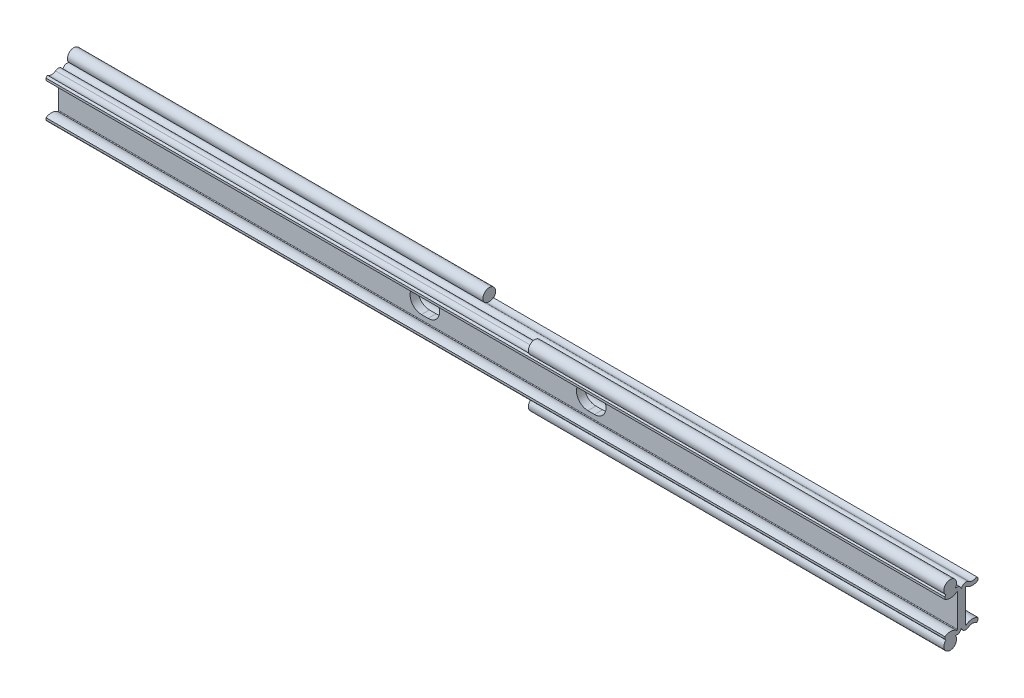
ISO-10303-21;
HEADER;
FILE_DESCRIPTION(('STEP AP214'),'2;1');
FILE_NAME('part.step','',(''),(''),'','','');
FILE_SCHEMA(('AUTOMOTIVE_DESIGN { 1 0 10303 214 1 1 1 1 }'));
ENDSEC;
DATA;
#1=APPLICATION_CONTEXT('core data for automotive mechanical design processes');
#2=APPLICATION_PROTOCOL_DEFINITION('international standard','automotive_design',2000,#1);
#3=PRODUCT_CONTEXT('',#1,'mechanical');
#4=PRODUCT('Part','Part','',(#3));
#5=PRODUCT_RELATED_PRODUCT_CATEGORY('part','',(#4));
#6=PRODUCT_DEFINITION_FORMATION('','',#4);
#7=PRODUCT_DEFINITION_CONTEXT('part definition',#1,'design');
#8=PRODUCT_DEFINITION('design','',#6,#7);
#9=PRODUCT_DEFINITION_SHAPE('','',#8);
#10=(LENGTH_UNIT() NAMED_UNIT(*) SI_UNIT(.MILLI.,.METRE.));
#11=(NAMED_UNIT(*) PLANE_ANGLE_UNIT() SI_UNIT($,.RADIAN.));
#12=(NAMED_UNIT(*) SI_UNIT($,.STERADIAN.) SOLID_ANGLE_UNIT());
#13=UNCERTAINTY_MEASURE_WITH_UNIT(LENGTH_MEASURE(1.E-05),#10,'distance_accuracy_value','');
#14=(GEOMETRIC_REPRESENTATION_CONTEXT(3) GLOBAL_UNCERTAINTY_ASSIGNED_CONTEXT((#13)) GLOBAL_UNIT_ASSIGNED_CONTEXT((#10,
#11,#12)) REPRESENTATION_CONTEXT('',''));
#15=CARTESIAN_POINT('',(0.,0.,0.));
#16=DIRECTION('',(0.,0.,1.));
#17=DIRECTION('',(1.,0.,0.));
#18=AXIS2_PLACEMENT_3D('',#15,#16,#17);
#19=CARTESIAN_POINT('',(-175.,9.67000022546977,4.31000011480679));
#20=DIRECTION('',(1.,0.,0.));
#21=DIRECTION('',(0.,0.,-1.));
#22=AXIS2_PLACEMENT_3D('',#19,#20,#21);
#23=CYLINDRICAL_SURFACE('',#22,2.48000011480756);
#24=CARTESIAN_POINT('',(13.2,9.67000022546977,4.31000011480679));
#25=DIRECTION('',(1.,0.,0.));
#26=DIRECTION('',(0.,0.,-1.));
#27=AXIS2_PLACEMENT_3D('',#24,#25,#26);
#28=CIRCLE('',#27,2.48000011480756);
#29=CARTESIAN_POINT('',(13.2,7.69573962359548,2.80910183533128));
#30=VERTEX_POINT('',#29);
#31=CARTESIAN_POINT('',(13.2,7.77020990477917,5.90411344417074));
#32=VERTEX_POINT('',#31);
#33=EDGE_CURVE('E323',#30,#32,#28,.F.);
#34=ORIENTED_EDGE('',*,*,#33,.F.);
#35=DIRECTION('',(1.,0.,0.));
#36=VECTOR('',#35,1.);
#37=CARTESIAN_POINT('',(-175.,7.69573962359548,2.80910183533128));
#38=LINE('',#37,#36);
#39=CARTESIAN_POINT('',(-175.,7.69573962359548,2.80910183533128));
#40=VERTEX_POINT('',#39);
#41=EDGE_CURVE('E545',#40,#30,#38,.T.);
#42=ORIENTED_EDGE('',*,*,#41,.F.);
#43=CARTESIAN_POINT('',(-175.,9.67000022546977,4.31000011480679));
#44=DIRECTION('',(1.,0.,0.));
#45=DIRECTION('',(0.,0.,-1.));
#46=AXIS2_PLACEMENT_3D('',#43,#44,#45);
#47=CIRCLE('',#46,2.48000011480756);
#48=CARTESIAN_POINT('',(-175.,7.77020990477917,5.90411344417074));
#49=VERTEX_POINT('',#48);
#50=EDGE_CURVE('E506',#49,#40,#47,.T.);
#51=ORIENTED_EDGE('',*,*,#50,.F.);
#52=DIRECTION('',(1.,0.,0.));
#53=VECTOR('',#52,1.);
#54=CARTESIAN_POINT('',(-175.,7.77020990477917,5.90411344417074));
#55=LINE('',#54,#53);
#56=EDGE_CURVE('E548',#49,#32,#55,.T.);
#57=ORIENTED_EDGE('',*,*,#56,.T.);
#58=EDGE_LOOP('',(#34,#42,#51,#57));
#59=FACE_BOUND('',#58,.T.);
#60=ADVANCED_FACE('F14',(#59),#23,.F.);
#61=CARTESIAN_POINT('',(-175.,9.67000022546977,-4.31000011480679));
#62=DIRECTION('',(1.,0.,0.));
#63=DIRECTION('',(0.,0.,-1.));
#64=AXIS2_PLACEMENT_3D('',#61,#62,#63);
#65=CYLINDRICAL_SURFACE('',#64,2.48000011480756);
#66=CARTESIAN_POINT('',(-13.2,9.67000022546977,-4.31000011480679));
#67=DIRECTION('',(-1.,0.,0.));
#68=DIRECTION('',(0.,0.,1.));
#69=AXIS2_PLACEMENT_3D('',#66,#67,#68);
#70=CIRCLE('',#69,2.48000011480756);
#71=CARTESIAN_POINT('',(-13.2,7.69573962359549,-2.80910183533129));
#72=VERTEX_POINT('',#71);
#73=CARTESIAN_POINT('',(-13.2,7.77020990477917,-5.90411344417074));
#74=VERTEX_POINT('',#73);
#75=EDGE_CURVE('E357',#72,#74,#70,.F.);
#76=ORIENTED_EDGE('',*,*,#75,.F.);
#77=DIRECTION('',(1.,0.,0.));
#78=VECTOR('',#77,1.);
#79=CARTESIAN_POINT('',(-175.,7.69573962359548,-2.80910183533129));
#80=LINE('',#79,#78);
#81=CARTESIAN_POINT('',(175.,7.69573962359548,-2.80910183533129));
#82=VERTEX_POINT('',#81);
#83=EDGE_CURVE('E540',#72,#82,#80,.T.);
#84=ORIENTED_EDGE('',*,*,#83,.T.);
#85=CARTESIAN_POINT('',(175.,9.67000022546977,-4.31000011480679));
#86=DIRECTION('',(1.,0.,0.));
#87=DIRECTION('',(0.,0.,1.));
#88=AXIS2_PLACEMENT_3D('',#85,#86,#87);
#89=CIRCLE('',#88,2.48000011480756);
#90=CARTESIAN_POINT('',(175.,7.77020990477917,-5.90411344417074));
#91=VERTEX_POINT('',#90);
#92=EDGE_CURVE('E459',#82,#91,#89,.T.);
#93=ORIENTED_EDGE('',*,*,#92,.T.);
#94=DIRECTION('',(1.,0.,0.));
#95=VECTOR('',#94,1.);
#96=CARTESIAN_POINT('',(-175.,7.77020990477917,-5.90411344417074));
#97=LINE('',#96,#95);
#98=EDGE_CURVE('E538',#74,#91,#97,.T.);
#99=ORIENTED_EDGE('',*,*,#98,.F.);
#100=EDGE_LOOP('',(#76,#84,#93,#99));
#101=FACE_BOUND('',#100,.T.);
#102=ADVANCED_FACE('F682',(#101),#65,.F.);
#103=CARTESIAN_POINT('',(-175.,-6.30261222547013,-1.75000011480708));
#104=DIRECTION('',(1.,0.,0.));
#105=DIRECTION('',(0.,0.,-1.));
#106=AXIS2_PLACEMENT_3D('',#103,#104,#105);
#107=CYLINDRICAL_SURFACE('',#106,0.200000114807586);
#108=CARTESIAN_POINT('',(175.,-6.30261222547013,-1.75000011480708));
#109=DIRECTION('',(1.,0.,0.));
#110=DIRECTION('',(0.,0.,-1.));
#111=AXIS2_PLACEMENT_3D('',#108,#109,#110);
#112=CIRCLE('',#111,0.200000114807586);
#113=CARTESIAN_POINT('',(175.,-6.30261222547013,-1.54999999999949));
#114=VERTEX_POINT('',#113);
#115=CARTESIAN_POINT('',(175.,-6.46182696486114,-1.87104024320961));
#116=VERTEX_POINT('',#115);
#117=EDGE_CURVE('E423',#114,#116,#112,.T.);
#118=ORIENTED_EDGE('',*,*,#117,.T.);
#119=DIRECTION('',(1.,0.,0.));
#120=VECTOR('',#119,1.);
#121=CARTESIAN_POINT('',(-175.,-6.46182696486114,-1.87104024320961));
#122=LINE('',#121,#120);
#123=CARTESIAN_POINT('',(-175.,-6.46182696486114,-1.87104024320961));
#124=VERTEX_POINT('',#123);
#125=EDGE_CURVE('E591',#124,#116,#122,.T.);
#126=ORIENTED_EDGE('',*,*,#125,.F.);
#127=CARTESIAN_POINT('',(-175.,-6.30261222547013,-1.75000011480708));
#128=DIRECTION('',(1.,0.,0.));
#129=DIRECTION('',(0.,0.,-1.));
#130=AXIS2_PLACEMENT_3D('',#127,#128,#129);
#131=CIRCLE('',#130,0.200000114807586);
#132=CARTESIAN_POINT('',(-175.,-6.30261222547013,-1.54999999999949));
#133=VERTEX_POINT('',#132);
#134=EDGE_CURVE('E472',#133,#124,#131,.T.);
#135=ORIENTED_EDGE('',*,*,#134,.F.);
#136=DIRECTION('',(1.,0.,0.));
#137=VECTOR('',#136,1.);
#138=CARTESIAN_POINT('',(-175.,-6.30261222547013,-1.54999999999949));
#139=LINE('',#138,#137);
#140=EDGE_CURVE('E523',#133,#114,#139,.T.);
#141=ORIENTED_EDGE('',*,*,#140,.T.);
#142=EDGE_LOOP('',(#118,#126,#135,#141));
#143=FACE_BOUND('',#142,.T.);
#144=ADVANCED_FACE('F16',(#143),#107,.F.);
#145=CARTESIAN_POINT('',(-175.,-9.67000022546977,-4.31000011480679));
#146=DIRECTION('',(1.,0.,0.));
#147=DIRECTION('',(0.,0.,-1.));
#148=AXIS2_PLACEMENT_3D('',#145,#146,#147);
#149=CYLINDRICAL_SURFACE('',#148,4.03000011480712);
#150=CARTESIAN_POINT('',(175.,-9.67000022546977,-4.31000011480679));
#151=DIRECTION('',(-1.,0.,0.));
#152=DIRECTION('',(0.,0.,-1.));
#153=AXIS2_PLACEMENT_3D('',#150,#151,#152);
#154=CIRCLE('',#153,4.03000011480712);
#155=CARTESIAN_POINT('',(175.,-6.26775086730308,-6.47000016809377));
#156=VERTEX_POINT('',#155);
#157=EDGE_CURVE('E426',#116,#156,#154,.T.);
#158=ORIENTED_EDGE('',*,*,#157,.T.);
#159=DIRECTION('',(1.,0.,0.));
#160=VECTOR('',#159,1.);
#161=CARTESIAN_POINT('',(-175.,-6.26775086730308,-6.47000016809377));
#162=LINE('',#161,#160);
#163=CARTESIAN_POINT('',(-175.,-6.26775086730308,-6.47000016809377));
#164=VERTEX_POINT('',#163);
#165=EDGE_CURVE('E588',#164,#156,#162,.T.);
#166=ORIENTED_EDGE('',*,*,#165,.F.);
#167=CARTESIAN_POINT('',(-175.,-9.67000022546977,-4.31000011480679));
#168=DIRECTION('',(-1.,0.,0.));
#169=DIRECTION('',(0.,0.,-1.));
#170=AXIS2_PLACEMENT_3D('',#167,#168,#169);
#171=CIRCLE('',#170,4.03000011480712);
#172=EDGE_CURVE('E475',#124,#164,#171,.T.);
#173=ORIENTED_EDGE('',*,*,#172,.F.);
#174=ORIENTED_EDGE('',*,*,#125,.T.);
#175=EDGE_LOOP('',(#158,#166,#173,#174));
#176=FACE_BOUND('',#175,.T.);
#177=ADVANCED_FACE('F731',(#176),#149,.T.);
#178=CARTESIAN_POINT('',(-175.,-6.26775086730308,-6.47000016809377));
#179=DIRECTION('',(0.,0.,1.));
#180=DIRECTION('',(1.,0.,0.));
#181=AXIS2_PLACEMENT_3D('',#178,#179,#180);
#182=PLANE('',#181);
#183=DIRECTION('',(0.,-1.,0.));
#184=VECTOR('',#183,1.);
#185=CARTESIAN_POINT('',(175.,-6.26775086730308,-6.47000016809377));
#186=LINE('',#185,#184);
#187=CARTESIAN_POINT('',(175.,-7.09581212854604,-6.47000016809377));
#188=VERTEX_POINT('',#187);
#189=EDGE_CURVE('E428',#156,#188,#186,.T.);
#190=ORIENTED_EDGE('',*,*,#189,.T.);
#191=DIRECTION('',(1.,0.,0.));
#192=VECTOR('',#191,1.);
#193=CARTESIAN_POINT('',(-175.,-7.09581212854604,-6.47000016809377));
#194=LINE('',#193,#192);
#195=CARTESIAN_POINT('',(-175.,-7.09581212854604,-6.47000016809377));
#196=VERTEX_POINT('',#195);
#197=EDGE_CURVE('E585',#196,#188,#194,.T.);
#198=ORIENTED_EDGE('',*,*,#197,.F.);
#199=DIRECTION('',(0.,-1.,0.));
#200=VECTOR('',#199,1.);
#201=CARTESIAN_POINT('',(-175.,-6.26775086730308,-6.47000016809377));
#202=LINE('',#201,#200);
#203=EDGE_CURVE('E477',#164,#196,#202,.T.);
#204=ORIENTED_EDGE('',*,*,#203,.F.);
#205=ORIENTED_EDGE('',*,*,#165,.T.);
#206=EDGE_LOOP('',(#190,#198,#204,#205));
#207=FACE_BOUND('',#206,.T.);
#208=ADVANCED_FACE('F728',(#207),#182,.F.);
#209=CARTESIAN_POINT('',(-175.,-7.77020990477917,-5.90411344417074));
#210=DIRECTION('',(0.,0.642787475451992,0.766044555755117));
#211=DIRECTION('',(0.,0.766044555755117,-0.642787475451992));
#212=AXIS2_PLACEMENT_3D('',#209,#210,#211);
#213=PLANE('',#212);
#214=DIRECTION('',(0.,0.766044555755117,-0.642787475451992));
#215=VECTOR('',#214,1.);
#216=CARTESIAN_POINT('',(-13.2,-7.77020990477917,-5.90411344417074));
#217=LINE('',#216,#215);
#218=CARTESIAN_POINT('',(-13.2,-7.77020990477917,-5.90411344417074));
#219=VERTEX_POINT('',#218);
#220=CARTESIAN_POINT('',(-13.2,-7.62948341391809,-6.02219694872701));
#221=VERTEX_POINT('',#220);
#222=EDGE_CURVE('E343',#219,#221,#217,.T.);
#223=ORIENTED_EDGE('',*,*,#222,.T.);
#224=DIRECTION('',(-1.,0.,0.));
#225=VECTOR('',#224,1.);
#226=CARTESIAN_POINT('',(-13.2,-7.62948341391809,-6.02219694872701));
#227=LINE('',#226,#225);
#228=CARTESIAN_POINT('',(-175.,-7.62948341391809,-6.02219694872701));
#229=VERTEX_POINT('',#228);
#230=EDGE_CURVE('E337',#221,#229,#227,.T.);
#231=ORIENTED_EDGE('',*,*,#230,.T.);
#232=DIRECTION('',(0.,-0.766044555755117,0.642787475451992));
#233=VECTOR('',#232,1.);
#234=CARTESIAN_POINT('',(-175.,-7.77020990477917,-5.90411344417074));
#235=LINE('',#234,#233);
#236=EDGE_CURVE('E479',#196,#229,#235,.T.);
#237=ORIENTED_EDGE('',*,*,#236,.F.);
#238=ORIENTED_EDGE('',*,*,#197,.T.);
#239=DIRECTION('',(0.,-0.766044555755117,0.642787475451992));
#240=VECTOR('',#239,1.);
#241=CARTESIAN_POINT('',(175.,-7.77020990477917,-5.90411344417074));
#242=LINE('',#241,#240);
#243=CARTESIAN_POINT('',(175.,-7.77020990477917,-5.90411344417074));
#244=VERTEX_POINT('',#243);
#245=EDGE_CURVE('E430',#188,#244,#242,.T.);
#246=ORIENTED_EDGE('',*,*,#245,.T.);
#247=DIRECTION('',(1.,0.,0.));
#248=VECTOR('',#247,1.);
#249=CARTESIAN_POINT('',(-175.,-7.77020990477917,-5.90411344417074));
#250=LINE('',#249,#248);
#251=EDGE_CURVE('E583',#219,#244,#250,.T.);
#252=ORIENTED_EDGE('',*,*,#251,.F.);
#253=EDGE_LOOP('',(#223,#231,#237,#238,#246,#252));
#254=FACE_BOUND('',#253,.T.);
#255=ADVANCED_FACE('F724',(#254),#213,.F.);
#256=CARTESIAN_POINT('',(-175.,-9.67000022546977,-4.31000011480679));
#257=DIRECTION('',(1.,0.,0.));
#258=DIRECTION('',(0.,0.,-1.));
#259=AXIS2_PLACEMENT_3D('',#256,#257,#258);
#260=CYLINDRICAL_SURFACE('',#259,2.48000011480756);
#261=DIRECTION('',(1.,0.,0.));
#262=VECTOR('',#261,1.);
#263=CARTESIAN_POINT('',(-175.,-7.69573962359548,-2.80910183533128));
#264=LINE('',#263,#262);
#265=CARTESIAN_POINT('',(-13.2,-7.69573962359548,-2.80910183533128));
#266=VERTEX_POINT('',#265);
#267=CARTESIAN_POINT('',(175.,-7.69573962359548,-2.80910183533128));
#268=VERTEX_POINT('',#267);
#269=EDGE_CURVE('E581',#266,#268,#264,.T.);
#270=ORIENTED_EDGE('',*,*,#269,.F.);
#271=CARTESIAN_POINT('',(-13.2,-9.67000022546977,-4.31000011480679));
#272=DIRECTION('',(1.,0.,0.));
#273=DIRECTION('',(0.,0.,-1.));
#274=AXIS2_PLACEMENT_3D('',#271,#272,#273);
#275=CIRCLE('',#274,2.48000011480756);
#276=EDGE_CURVE('E340',#266,#219,#275,.F.);
#277=ORIENTED_EDGE('',*,*,#276,.T.);
#278=ORIENTED_EDGE('',*,*,#251,.T.);
#279=CARTESIAN_POINT('',(175.,-9.67000022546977,-4.31000011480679));
#280=DIRECTION('',(1.,0.,0.));
#281=DIRECTION('',(0.,0.,-1.));
#282=AXIS2_PLACEMENT_3D('',#279,#280,#281);
#283=CIRCLE('',#282,2.48000011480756);
#284=EDGE_CURVE('E433',#244,#268,#283,.T.);
#285=ORIENTED_EDGE('',*,*,#284,.T.);
#286=EDGE_LOOP('',(#270,#277,#278,#285));
#287=FACE_BOUND('',#286,.T.);
#288=ADVANCED_FACE('F720',(#287),#260,.F.);
#289=CARTESIAN_POINT('',(-175.,-6.30261222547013,-1.75000011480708));
#290=DIRECTION('',(1.,0.,0.));
#291=DIRECTION('',(0.,0.,-1.));
#292=AXIS2_PLACEMENT_3D('',#289,#290,#291);
#293=CYLINDRICAL_SURFACE('',#292,1.75000011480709);
#294=CARTESIAN_POINT('',(-175.,-6.30261222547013,-1.75000011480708));
#295=DIRECTION('',(-1.,0.,0.));
#296=DIRECTION('',(0.,0.,-1.));
#297=AXIS2_PLACEMENT_3D('',#294,#295,#296);
#298=CIRCLE('',#297,1.75000011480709);
#299=CARTESIAN_POINT('',(-175.,-7.91637379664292,-2.42695948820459));
#300=VERTEX_POINT('',#299);
#301=CARTESIAN_POINT('',(-175.,-6.30261222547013,0.));
#302=VERTEX_POINT('',#301);
#303=EDGE_CURVE('E482',#300,#302,#298,.T.);
#304=ORIENTED_EDGE('',*,*,#303,.F.);
#305=DIRECTION('',(-1.,0.,0.));
#306=VECTOR('',#305,1.);
#307=CARTESIAN_POINT('',(-94.1,-7.91637379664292,-2.42695948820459));
#308=LINE('',#307,#306);
#309=CARTESIAN_POINT('',(-13.2,-7.91637379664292,-2.42695948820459));
#310=VERTEX_POINT('',#309);
#311=EDGE_CURVE('E333',#300,#310,#308,.F.);
#312=ORIENTED_EDGE('',*,*,#311,.T.);
#313=CARTESIAN_POINT('',(-13.2,-6.30261222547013,-1.75000011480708));
#314=DIRECTION('',(1.,0.,0.));
#315=DIRECTION('',(0.,0.,-1.));
#316=AXIS2_PLACEMENT_3D('',#313,#314,#315);
#317=CIRCLE('',#316,1.75000011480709);
#318=EDGE_CURVE('E596',#310,#266,#317,.T.);
#319=ORIENTED_EDGE('',*,*,#318,.T.);
#320=ORIENTED_EDGE('',*,*,#269,.T.);
#321=CARTESIAN_POINT('',(175.,-6.30261222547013,-1.75000011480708));
#322=DIRECTION('',(-1.,0.,0.));
#323=DIRECTION('',(0.,0.,-1.));
#324=AXIS2_PLACEMENT_3D('',#321,#322,#323);
#325=CIRCLE('',#324,1.75000011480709);
#326=CARTESIAN_POINT('',(175.,-6.30261222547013,0.));
#327=VERTEX_POINT('',#326);
#328=EDGE_CURVE('E436',#268,#327,#325,.T.);
#329=ORIENTED_EDGE('',*,*,#328,.T.);
#330=DIRECTION('',(1.,0.,0.));
#331=VECTOR('',#330,1.);
#332=CARTESIAN_POINT('',(-175.,-6.30261222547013,0.));
#333=LINE('',#332,#331);
#334=EDGE_CURVE('E578',#302,#327,#333,.T.);
#335=ORIENTED_EDGE('',*,*,#334,.F.);
#336=EDGE_LOOP('',(#304,#312,#319,#320,#329,#335));
#337=FACE_BOUND('',#336,.T.);
#338=ADVANCED_FACE('F717',(#337),#293,.T.);
#339=CARTESIAN_POINT('',(-175.,-6.30261222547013,1.75000011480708));
#340=DIRECTION('',(1.,0.,0.));
#341=DIRECTION('',(0.,0.,-1.));
#342=AXIS2_PLACEMENT_3D('',#339,#340,#341);
#343=CYLINDRICAL_SURFACE('',#342,1.75000011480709);
#344=CARTESIAN_POINT('',(175.,-6.30261222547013,1.75000011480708));
#345=DIRECTION('',(-1.,0.,0.));
#346=DIRECTION('',(0.,0.,1.));
#347=AXIS2_PLACEMENT_3D('',#344,#345,#346);
#348=CIRCLE('',#347,1.75000011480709);
#349=CARTESIAN_POINT('',(175.,-7.91637379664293,2.42695948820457));
#350=VERTEX_POINT('',#349);
#351=EDGE_CURVE('E292',#327,#350,#348,.T.);
#352=ORIENTED_EDGE('',*,*,#351,.T.);
#353=DIRECTION('',(1.,0.,0.));
#354=VECTOR('',#353,1.);
#355=CARTESIAN_POINT('',(94.1,-7.91637379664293,2.42695948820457));
#356=LINE('',#355,#354);
#357=CARTESIAN_POINT('',(13.2,-7.91637379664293,2.42695948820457));
#358=VERTEX_POINT('',#357);
#359=EDGE_CURVE('E29',#350,#358,#356,.F.);
#360=ORIENTED_EDGE('',*,*,#359,.T.);
#361=CARTESIAN_POINT('',(13.2,-6.30261222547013,1.75000011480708));
#362=DIRECTION('',(-1.,0.,0.));
#363=DIRECTION('',(0.,0.,1.));
#364=AXIS2_PLACEMENT_3D('',#361,#362,#363);
#365=CIRCLE('',#364,1.75000011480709);
#366=CARTESIAN_POINT('',(13.2,-7.69573962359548,2.80910183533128));
#367=VERTEX_POINT('',#366);
#368=EDGE_CURVE('E33',#358,#367,#365,.T.);
#369=ORIENTED_EDGE('',*,*,#368,.T.);
#370=DIRECTION('',(1.,0.,0.));
#371=VECTOR('',#370,1.);
#372=CARTESIAN_POINT('',(-175.,-7.69573962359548,2.80910183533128));
#373=LINE('',#372,#371);
#374=CARTESIAN_POINT('',(-175.,-7.69573962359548,2.80910183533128));
#375=VERTEX_POINT('',#374);
#376=EDGE_CURVE('E576',#375,#367,#373,.T.);
#377=ORIENTED_EDGE('',*,*,#376,.F.);
#378=CARTESIAN_POINT('',(-175.,-6.30261222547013,1.75000011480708));
#379=DIRECTION('',(-1.,0.,0.));
#380=DIRECTION('',(0.,0.,1.));
#381=AXIS2_PLACEMENT_3D('',#378,#379,#380);
#382=CIRCLE('',#381,1.75000011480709);
#383=EDGE_CURVE('E484',#302,#375,#382,.T.);
#384=ORIENTED_EDGE('',*,*,#383,.F.);
#385=ORIENTED_EDGE('',*,*,#334,.T.);
#386=EDGE_LOOP('',(#352,#360,#369,#377,#384,#385));
#387=FACE_BOUND('',#386,.T.);
#388=ADVANCED_FACE('F714',(#387),#343,.T.);
#389=CARTESIAN_POINT('',(-175.,-9.67000022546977,4.31000011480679));
#390=DIRECTION('',(1.,0.,0.));
#391=DIRECTION('',(0.,0.,-1.));
#392=AXIS2_PLACEMENT_3D('',#389,#390,#391);
#393=CYLINDRICAL_SURFACE('',#392,2.48000011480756);
#394=ORIENTED_EDGE('',*,*,#376,.T.);
#395=CARTESIAN_POINT('',(13.2,-9.67000022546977,4.31000011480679));
#396=DIRECTION('',(-1.,0.,0.));
#397=DIRECTION('',(0.,0.,1.));
#398=AXIS2_PLACEMENT_3D('',#395,#396,#397);
#399=CIRCLE('',#398,2.48000011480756);
#400=CARTESIAN_POINT('',(13.2,-7.77020990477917,5.90411344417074));
#401=VERTEX_POINT('',#400);
#402=EDGE_CURVE('E309',#367,#401,#399,.F.);
#403=ORIENTED_EDGE('',*,*,#402,.T.);
#404=DIRECTION('',(1.,0.,0.));
#405=VECTOR('',#404,1.);
#406=CARTESIAN_POINT('',(-175.,-7.77020990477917,5.90411344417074));
#407=LINE('',#406,#405);
#408=CARTESIAN_POINT('',(-175.,-7.77020990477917,5.90411344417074));
#409=VERTEX_POINT('',#408);
#410=EDGE_CURVE('E574',#409,#401,#407,.T.);
#411=ORIENTED_EDGE('',*,*,#410,.F.);
#412=CARTESIAN_POINT('',(-175.,-9.67000022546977,4.31000011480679));
#413=DIRECTION('',(1.,0.,0.));
#414=DIRECTION('',(0.,0.,1.));
#415=AXIS2_PLACEMENT_3D('',#412,#413,#414);
#416=CIRCLE('',#415,2.48000011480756);
#417=EDGE_CURVE('E486',#375,#409,#416,.T.);
#418=ORIENTED_EDGE('',*,*,#417,.F.);
#419=EDGE_LOOP('',(#394,#403,#411,#418));
#420=FACE_BOUND('',#419,.T.);
#421=ADVANCED_FACE('F667',(#420),#393,.F.);
#422=CARTESIAN_POINT('',(-175.,-7.77020990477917,5.90411344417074));
#423=DIRECTION('',(0.,0.642787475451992,-0.766044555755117));
#424=DIRECTION('',(0.,-0.766044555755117,-0.642787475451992));
#425=AXIS2_PLACEMENT_3D('',#422,#423,#424);
#426=PLANE('',#425);
#427=DIRECTION('',(0.,0.766044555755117,0.642787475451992));
#428=VECTOR('',#427,1.);
#429=CARTESIAN_POINT('',(13.2,-7.77020990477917,5.90411344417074));
#430=LINE('',#429,#428);
#431=CARTESIAN_POINT('',(13.2,-7.62948341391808,6.02219694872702));
#432=VERTEX_POINT('',#431);
#433=EDGE_CURVE('E9',#401,#432,#430,.T.);
#434=ORIENTED_EDGE('',*,*,#433,.T.);
#435=DIRECTION('',(1.,0.,0.));
#436=VECTOR('',#435,1.);
#437=CARTESIAN_POINT('',(13.2,-7.62948341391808,6.02219694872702));
#438=LINE('',#437,#436);
#439=CARTESIAN_POINT('',(175.,-7.62948341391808,6.02219694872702));
#440=VERTEX_POINT('',#439);
#441=EDGE_CURVE('E295',#432,#440,#438,.T.);
#442=ORIENTED_EDGE('',*,*,#441,.T.);
#443=DIRECTION('',(0.,0.766044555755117,0.642787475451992));
#444=VECTOR('',#443,1.);
#445=CARTESIAN_POINT('',(175.,-7.77020990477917,5.90411344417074));
#446=LINE('',#445,#444);
#447=CARTESIAN_POINT('',(175.,-7.09581212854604,6.47000016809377));
#448=VERTEX_POINT('',#447);
#449=EDGE_CURVE('E281',#440,#448,#446,.T.);
#450=ORIENTED_EDGE('',*,*,#449,.T.);
#451=DIRECTION('',(1.,0.,0.));
#452=VECTOR('',#451,1.);
#453=CARTESIAN_POINT('',(-175.,-7.09581212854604,6.47000016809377));
#454=LINE('',#453,#452);
#455=CARTESIAN_POINT('',(-175.,-7.09581212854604,6.47000016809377));
#456=VERTEX_POINT('',#455);
#457=EDGE_CURVE('E572',#456,#448,#454,.T.);
#458=ORIENTED_EDGE('',*,*,#457,.F.);
#459=DIRECTION('',(0.,0.766044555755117,0.642787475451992));
#460=VECTOR('',#459,1.);
#461=CARTESIAN_POINT('',(-175.,-7.77020990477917,5.90411344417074));
#462=LINE('',#461,#460);
#463=EDGE_CURVE('E488',#409,#456,#462,.T.);
#464=ORIENTED_EDGE('',*,*,#463,.F.);
#465=ORIENTED_EDGE('',*,*,#410,.T.);
#466=EDGE_LOOP('',(#434,#442,#450,#458,#464,#465));
#467=FACE_BOUND('',#466,.T.);
#468=ADVANCED_FACE('F296',(#467),#426,.F.);
#469=CARTESIAN_POINT('',(-175.,-6.26775086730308,6.47000016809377));
#470=DIRECTION('',(0.,0.,-1.));
#471=DIRECTION('',(-1.,0.,0.));
#472=AXIS2_PLACEMENT_3D('',#469,#470,#471);
#473=PLANE('',#472);
#474=DIRECTION('',(0.,1.,0.));
#475=VECTOR('',#474,1.);
#476=CARTESIAN_POINT('',(175.,-6.26775086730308,6.47000016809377));
#477=LINE('',#476,#475);
#478=CARTESIAN_POINT('',(175.,-6.26775086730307,6.47000016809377));
#479=VERTEX_POINT('',#478);
#480=EDGE_CURVE('E288',#448,#479,#477,.T.);
#481=ORIENTED_EDGE('',*,*,#480,.T.);
#482=DIRECTION('',(1.,0.,0.));
#483=VECTOR('',#482,1.);
#484=CARTESIAN_POINT('',(-175.,-6.26775086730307,6.47000016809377));
#485=LINE('',#484,#483);
#486=CARTESIAN_POINT('',(-175.,-6.26775086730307,6.47000016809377));
#487=VERTEX_POINT('',#486);
#488=EDGE_CURVE('E569',#487,#479,#485,.T.);
#489=ORIENTED_EDGE('',*,*,#488,.F.);
#490=DIRECTION('',(0.,1.,0.));
#491=VECTOR('',#490,1.);
#492=CARTESIAN_POINT('',(-175.,-6.26775086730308,6.47000016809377));
#493=LINE('',#492,#491);
#494=EDGE_CURVE('E490',#456,#487,#493,.T.);
#495=ORIENTED_EDGE('',*,*,#494,.F.);
#496=ORIENTED_EDGE('',*,*,#457,.T.);
#497=EDGE_LOOP('',(#481,#489,#495,#496));
#498=FACE_BOUND('',#497,.T.);
#499=ADVANCED_FACE('F661',(#498),#473,.F.);
#500=CARTESIAN_POINT('',(-175.,-9.67000022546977,4.31000011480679));
#501=DIRECTION('',(1.,0.,0.));
#502=DIRECTION('',(0.,0.,-1.));
#503=AXIS2_PLACEMENT_3D('',#500,#501,#502);
#504=CYLINDRICAL_SURFACE('',#503,4.03000011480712);
#505=CARTESIAN_POINT('',(175.,-9.67000022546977,4.31000011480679));
#506=DIRECTION('',(-1.,0.,0.));
#507=DIRECTION('',(0.,0.,1.));
#508=AXIS2_PLACEMENT_3D('',#505,#506,#507);
#509=CIRCLE('',#508,4.03000011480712);
#510=CARTESIAN_POINT('',(175.,-6.46182696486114,1.87104024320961));
#511=VERTEX_POINT('',#510);
#512=EDGE_CURVE('E440',#479,#511,#509,.T.);
#513=ORIENTED_EDGE('',*,*,#512,.T.);
#514=DIRECTION('',(1.,0.,0.));
#515=VECTOR('',#514,1.);
#516=CARTESIAN_POINT('',(-175.,-6.46182696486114,1.87104024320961));
#517=LINE('',#516,#515);
#518=CARTESIAN_POINT('',(-175.,-6.46182696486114,1.87104024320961));
#519=VERTEX_POINT('',#518);
#520=EDGE_CURVE('E566',#519,#511,#517,.T.);
#521=ORIENTED_EDGE('',*,*,#520,.F.);
#522=CARTESIAN_POINT('',(-175.,-9.67000022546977,4.31000011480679));
#523=DIRECTION('',(-1.,0.,0.));
#524=DIRECTION('',(0.,0.,1.));
#525=AXIS2_PLACEMENT_3D('',#522,#523,#524);
#526=CIRCLE('',#525,4.03000011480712);
#527=EDGE_CURVE('E492',#487,#519,#526,.T.);
#528=ORIENTED_EDGE('',*,*,#527,.F.);
#529=ORIENTED_EDGE('',*,*,#488,.T.);
#530=EDGE_LOOP('',(#513,#521,#528,#529));
#531=FACE_BOUND('',#530,.T.);
#532=ADVANCED_FACE('F657',(#531),#504,.T.);
#533=CARTESIAN_POINT('',(-175.,-6.30261222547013,1.75000011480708));
#534=DIRECTION('',(1.,0.,0.));
#535=DIRECTION('',(0.,0.,-1.));
#536=AXIS2_PLACEMENT_3D('',#533,#534,#535);
#537=CYLINDRICAL_SURFACE('',#536,0.200000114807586);
#538=CARTESIAN_POINT('',(175.,-6.30261222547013,1.75000011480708));
#539=DIRECTION('',(1.,0.,0.));
#540=DIRECTION('',(0.,0.,1.));
#541=AXIS2_PLACEMENT_3D('',#538,#539,#540);
#542=CIRCLE('',#541,0.200000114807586);
#543=CARTESIAN_POINT('',(175.,-6.30261222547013,1.54999999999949));
#544=VERTEX_POINT('',#543);
#545=EDGE_CURVE('E442',#511,#544,#542,.T.);
#546=ORIENTED_EDGE('',*,*,#545,.T.);
#547=DIRECTION('',(1.,0.,0.));
#548=VECTOR('',#547,1.);
#549=CARTESIAN_POINT('',(-175.,-6.30261222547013,1.54999999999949));
#550=LINE('',#549,#548);
#551=CARTESIAN_POINT('',(-175.,-6.30261222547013,1.54999999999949));
#552=VERTEX_POINT('',#551);
#553=EDGE_CURVE('E563',#552,#544,#550,.T.);
#554=ORIENTED_EDGE('',*,*,#553,.F.);
#555=CARTESIAN_POINT('',(-175.,-6.30261222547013,1.75000011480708));
#556=DIRECTION('',(1.,0.,0.));
#557=DIRECTION('',(0.,0.,1.));
#558=AXIS2_PLACEMENT_3D('',#555,#556,#557);
#559=CIRCLE('',#558,0.200000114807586);
#560=EDGE_CURVE('E494',#519,#552,#559,.T.);
#561=ORIENTED_EDGE('',*,*,#560,.F.);
#562=ORIENTED_EDGE('',*,*,#520,.T.);
#563=EDGE_LOOP('',(#546,#554,#561,#562));
#564=FACE_BOUND('',#563,.T.);
#565=ADVANCED_FACE('F652',(#564),#537,.F.);
#566=CARTESIAN_POINT('',(-175.,-6.30261222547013,1.54999999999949));
#567=DIRECTION('',(0.,0.,-1.));
#568=DIRECTION('',(-1.,0.,0.));
#569=AXIS2_PLACEMENT_3D('',#566,#567,#568);
#570=PLANE('',#569);
#571=DIRECTION('',(1.,0.,0.));
#572=VECTOR('',#571,1.);
#573=CARTESIAN_POINT('',(-33.7,-4.45,1.54999999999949));
#574=LINE('',#573,#572);
#575=CARTESIAN_POINT('',(-33.7,-4.45,1.54999999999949));
#576=VERTEX_POINT('',#575);
#577=CARTESIAN_POINT('',(-31.1,-4.45,1.54999999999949));
#578=VERTEX_POINT('',#577);
#579=EDGE_CURVE('E371',#576,#578,#574,.T.);
#580=ORIENTED_EDGE('',*,*,#579,.F.);
#581=CARTESIAN_POINT('',(-33.7,0.,1.54999999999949));
#582=DIRECTION('',(0.,0.,1.));
#583=DIRECTION('',(-1.,0.,0.));
#584=AXIS2_PLACEMENT_3D('',#581,#582,#583);
#585=CIRCLE('',#584,4.45);
#586=CARTESIAN_POINT('',(-33.7,4.45,1.54999999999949));
#587=VERTEX_POINT('',#586);
#588=EDGE_CURVE('E369',#587,#576,#585,.T.);
#589=ORIENTED_EDGE('',*,*,#588,.F.);
#590=DIRECTION('',(-1.,0.,0.));
#591=VECTOR('',#590,1.);
#592=CARTESIAN_POINT('',(-31.1,4.45,1.54999999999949));
#593=LINE('',#592,#591);
#594=CARTESIAN_POINT('',(-31.1,4.45,1.54999999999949));
#595=VERTEX_POINT('',#594);
#596=EDGE_CURVE('E377',#595,#587,#593,.T.);
#597=ORIENTED_EDGE('',*,*,#596,.F.);
#598=CARTESIAN_POINT('',(-31.1,0.,1.54999999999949));
#599=DIRECTION('',(0.,0.,1.));
#600=DIRECTION('',(-1.,0.,0.));
#601=AXIS2_PLACEMENT_3D('',#598,#599,#600);
#602=CIRCLE('',#601,4.45);
#603=EDGE_CURVE('E374',#578,#595,#602,.T.);
#604=ORIENTED_EDGE('',*,*,#603,.F.);
#605=EDGE_LOOP('',(#580,#589,#597,#604));
#606=FACE_BOUND('',#605,.T.);
#607=DIRECTION('',(1.,0.,0.));
#608=VECTOR('',#607,1.);
#609=CARTESIAN_POINT('',(33.7,-4.45,1.54999999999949));
#610=LINE('',#609,#608);
#611=CARTESIAN_POINT('',(31.1,-4.45,1.54999999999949));
#612=VERTEX_POINT('',#611);
#613=CARTESIAN_POINT('',(33.7,-4.45,1.54999999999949));
#614=VERTEX_POINT('',#613);
#615=EDGE_CURVE('E402',#612,#614,#610,.T.);
#616=ORIENTED_EDGE('',*,*,#615,.F.);
#617=CARTESIAN_POINT('',(31.1,0.,1.54999999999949));
#618=DIRECTION('',(0.,0.,1.));
#619=DIRECTION('',(1.,0.,0.));
#620=AXIS2_PLACEMENT_3D('',#617,#618,#619);
#621=CIRCLE('',#620,4.45);
#622=CARTESIAN_POINT('',(31.1,4.45,1.54999999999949));
#623=VERTEX_POINT('',#622);
#624=EDGE_CURVE('E400',#623,#612,#621,.T.);
#625=ORIENTED_EDGE('',*,*,#624,.F.);
#626=DIRECTION('',(-1.,0.,0.));
#627=VECTOR('',#626,1.);
#628=CARTESIAN_POINT('',(31.1,4.45,1.54999999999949));
#629=LINE('',#628,#627);
#630=CARTESIAN_POINT('',(33.7,4.45,1.54999999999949));
#631=VERTEX_POINT('',#630);
#632=EDGE_CURVE('E408',#631,#623,#629,.T.);
#633=ORIENTED_EDGE('',*,*,#632,.F.);
#634=CARTESIAN_POINT('',(33.7,0.,1.54999999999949));
#635=DIRECTION('',(0.,0.,1.));
#636=DIRECTION('',(1.,0.,0.));
#637=AXIS2_PLACEMENT_3D('',#634,#635,#636);
#638=CIRCLE('',#637,4.45);
#639=EDGE_CURVE('E405',#614,#631,#638,.T.);
#640=ORIENTED_EDGE('',*,*,#639,.F.);
#641=EDGE_LOOP('',(#616,#625,#633,#640));
#642=FACE_BOUND('',#641,.T.);
#643=DIRECTION('',(0.,1.,0.));
#644=VECTOR('',#643,1.);
#645=CARTESIAN_POINT('',(175.,-6.30261222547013,1.54999999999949));
#646=LINE('',#645,#644);
#647=CARTESIAN_POINT('',(175.,6.30261222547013,1.54999999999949));
#648=VERTEX_POINT('',#647);
#649=EDGE_CURVE('E444',#544,#648,#646,.T.);
#650=ORIENTED_EDGE('',*,*,#649,.T.);
#651=DIRECTION('',(1.,0.,0.));
#652=VECTOR('',#651,1.);
#653=CARTESIAN_POINT('',(-175.,6.30261222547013,1.54999999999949));
#654=LINE('',#653,#652);
#655=CARTESIAN_POINT('',(-175.,6.30261222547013,1.54999999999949));
#656=VERTEX_POINT('',#655);
#657=EDGE_CURVE('E560',#656,#648,#654,.T.);
#658=ORIENTED_EDGE('',*,*,#657,.F.);
#659=DIRECTION('',(0.,1.,0.));
#660=VECTOR('',#659,1.);
#661=CARTESIAN_POINT('',(-175.,-6.30261222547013,1.54999999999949));
#662=LINE('',#661,#660);
#663=EDGE_CURVE('E496',#552,#656,#662,.T.);
#664=ORIENTED_EDGE('',*,*,#663,.F.);
#665=ORIENTED_EDGE('',*,*,#553,.T.);
#666=EDGE_LOOP('',(#650,#658,#664,#665));
#667=FACE_BOUND('',#666,.T.);
#668=ADVANCED_FACE('F648',(#606,#642,#667),#570,.F.);
#669=CARTESIAN_POINT('',(-175.,6.30261222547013,1.75000011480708));
#670=DIRECTION('',(1.,0.,0.));
#671=DIRECTION('',(0.,0.,-1.));
#672=AXIS2_PLACEMENT_3D('',#669,#670,#671);
#673=CYLINDRICAL_SURFACE('',#672,0.200000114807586);
#674=CARTESIAN_POINT('',(175.,6.30261222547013,1.75000011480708));
#675=DIRECTION('',(1.,0.,0.));
#676=DIRECTION('',(0.,0.,-1.));
#677=AXIS2_PLACEMENT_3D('',#674,#675,#676);
#678=CIRCLE('',#677,0.200000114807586);
#679=CARTESIAN_POINT('',(175.,6.46182696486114,1.87104024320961));
#680=VERTEX_POINT('',#679);
#681=EDGE_CURVE('E446',#648,#680,#678,.T.);
#682=ORIENTED_EDGE('',*,*,#681,.T.);
#683=DIRECTION('',(1.,0.,0.));
#684=VECTOR('',#683,1.);
#685=CARTESIAN_POINT('',(-175.,6.46182696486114,1.87104024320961));
#686=LINE('',#685,#684);
#687=CARTESIAN_POINT('',(-175.,6.46182696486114,1.87104024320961));
#688=VERTEX_POINT('',#687);
#689=EDGE_CURVE('E557',#688,#680,#686,.T.);
#690=ORIENTED_EDGE('',*,*,#689,.F.);
#691=CARTESIAN_POINT('',(-175.,6.30261222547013,1.75000011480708));
#692=DIRECTION('',(1.,0.,0.));
#693=DIRECTION('',(0.,0.,-1.));
#694=AXIS2_PLACEMENT_3D('',#691,#692,#693);
#695=CIRCLE('',#694,0.200000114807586);
#696=EDGE_CURVE('E498',#656,#688,#695,.T.);
#697=ORIENTED_EDGE('',*,*,#696,.F.);
#698=ORIENTED_EDGE('',*,*,#657,.T.);
#699=EDGE_LOOP('',(#682,#690,#697,#698));
#700=FACE_BOUND('',#699,.T.);
#701=ADVANCED_FACE('F644',(#700),#673,.F.);
#702=CARTESIAN_POINT('',(-175.,9.67000022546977,4.31000011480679));
#703=DIRECTION('',(1.,0.,0.));
#704=DIRECTION('',(0.,0.,-1.));
#705=AXIS2_PLACEMENT_3D('',#702,#703,#704);
#706=CYLINDRICAL_SURFACE('',#705,4.03000011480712);
#707=CARTESIAN_POINT('',(175.,9.67000022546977,4.31000011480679));
#708=DIRECTION('',(-1.,0.,0.));
#709=DIRECTION('',(0.,0.,-1.));
#710=AXIS2_PLACEMENT_3D('',#707,#708,#709);
#711=CIRCLE('',#710,4.03000011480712);
#712=CARTESIAN_POINT('',(175.,6.26775086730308,6.47000016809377));
#713=VERTEX_POINT('',#712);
#714=EDGE_CURVE('E448',#680,#713,#711,.T.);
#715=ORIENTED_EDGE('',*,*,#714,.T.);
#716=DIRECTION('',(1.,0.,0.));
#717=VECTOR('',#716,1.);
#718=CARTESIAN_POINT('',(-175.,6.26775086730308,6.47000016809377));
#719=LINE('',#718,#717);
#720=CARTESIAN_POINT('',(-175.,6.26775086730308,6.47000016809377));
#721=VERTEX_POINT('',#720);
#722=EDGE_CURVE('E554',#721,#713,#719,.T.);
#723=ORIENTED_EDGE('',*,*,#722,.F.);
#724=CARTESIAN_POINT('',(-175.,9.67000022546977,4.31000011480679));
#725=DIRECTION('',(-1.,0.,0.));
#726=DIRECTION('',(0.,0.,-1.));
#727=AXIS2_PLACEMENT_3D('',#724,#725,#726);
#728=CIRCLE('',#727,4.03000011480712);
#729=EDGE_CURVE('E500',#688,#721,#728,.T.);
#730=ORIENTED_EDGE('',*,*,#729,.F.);
#731=ORIENTED_EDGE('',*,*,#689,.T.);
#732=EDGE_LOOP('',(#715,#723,#730,#731));
#733=FACE_BOUND('',#732,.T.);
#734=ADVANCED_FACE('F639',(#733),#706,.T.);
#735=CARTESIAN_POINT('',(-175.,6.26775086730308,6.47000016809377));
#736=DIRECTION('',(0.,0.,-1.));
#737=DIRECTION('',(-1.,0.,0.));
#738=AXIS2_PLACEMENT_3D('',#735,#736,#737);
#739=PLANE('',#738);
#740=DIRECTION('',(0.,1.,0.));
#741=VECTOR('',#740,1.);
#742=CARTESIAN_POINT('',(175.,6.26775086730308,6.47000016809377));
#743=LINE('',#742,#741);
#744=CARTESIAN_POINT('',(175.,7.09581212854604,6.47000016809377));
#745=VERTEX_POINT('',#744);
#746=EDGE_CURVE('E450',#713,#745,#743,.T.);
#747=ORIENTED_EDGE('',*,*,#746,.T.);
#748=DIRECTION('',(1.,0.,0.));
#749=VECTOR('',#748,1.);
#750=CARTESIAN_POINT('',(-175.,7.09581212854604,6.47000016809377));
#751=LINE('',#750,#749);
#752=CARTESIAN_POINT('',(-175.,7.09581212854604,6.47000016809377));
#753=VERTEX_POINT('',#752);
#754=EDGE_CURVE('E551',#753,#745,#751,.T.);
#755=ORIENTED_EDGE('',*,*,#754,.F.);
#756=DIRECTION('',(0.,1.,0.));
#757=VECTOR('',#756,1.);
#758=CARTESIAN_POINT('',(-175.,6.26775086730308,6.47000016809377));
#759=LINE('',#758,#757);
#760=EDGE_CURVE('E502',#721,#753,#759,.T.);
#761=ORIENTED_EDGE('',*,*,#760,.F.);
#762=ORIENTED_EDGE('',*,*,#722,.T.);
#763=EDGE_LOOP('',(#747,#755,#761,#762));
#764=FACE_BOUND('',#763,.T.);
#765=ADVANCED_FACE('F633',(#764),#739,.F.);
#766=CARTESIAN_POINT('',(-175.,7.77020990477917,5.90411344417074));
#767=DIRECTION('',(0.,-0.642787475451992,-0.766044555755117));
#768=DIRECTION('',(0.,-0.766044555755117,0.642787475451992));
#769=AXIS2_PLACEMENT_3D('',#766,#767,#768);
#770=PLANE('',#769);
#771=DIRECTION('',(0.,0.766044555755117,-0.642787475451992));
#772=VECTOR('',#771,1.);
#773=CARTESIAN_POINT('',(175.,7.77020990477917,5.90411344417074));
#774=LINE('',#773,#772);
#775=CARTESIAN_POINT('',(175.,7.62948341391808,6.02219694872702));
#776=VERTEX_POINT('',#775);
#777=EDGE_CURVE('E452',#745,#776,#774,.T.);
#778=ORIENTED_EDGE('',*,*,#777,.T.);
#779=DIRECTION('',(1.,0.,0.));
#780=VECTOR('',#779,1.);
#781=CARTESIAN_POINT('',(13.2,7.62948341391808,6.02219694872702));
#782=LINE('',#781,#780);
#783=CARTESIAN_POINT('',(13.2,7.62948341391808,6.02219694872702));
#784=VERTEX_POINT('',#783);
#785=EDGE_CURVE('E321',#776,#784,#782,.F.);
#786=ORIENTED_EDGE('',*,*,#785,.T.);
#787=DIRECTION('',(0.,-0.766044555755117,0.642787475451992));
#788=VECTOR('',#787,1.);
#789=CARTESIAN_POINT('',(13.2,7.77020990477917,5.90411344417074));
#790=LINE('',#789,#788);
#791=EDGE_CURVE('E326',#32,#784,#790,.T.);
#792=ORIENTED_EDGE('',*,*,#791,.F.);
#793=ORIENTED_EDGE('',*,*,#56,.F.);
#794=DIRECTION('',(0.,0.766044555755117,-0.642787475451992));
#795=VECTOR('',#794,1.);
#796=CARTESIAN_POINT('',(-175.,7.77020990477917,5.90411344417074));
#797=LINE('',#796,#795);
#798=EDGE_CURVE('E504',#753,#49,#797,.T.);
#799=ORIENTED_EDGE('',*,*,#798,.F.);
#800=ORIENTED_EDGE('',*,*,#754,.T.);
#801=EDGE_LOOP('',(#778,#786,#792,#793,#799,#800));
#802=FACE_BOUND('',#801,.T.);
#803=ADVANCED_FACE('F629',(#802),#770,.F.);
#804=CARTESIAN_POINT('',(-175.,6.30261222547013,1.75000011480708));
#805=DIRECTION('',(1.,0.,0.));
#806=DIRECTION('',(0.,0.,-1.));
#807=AXIS2_PLACEMENT_3D('',#804,#805,#806);
#808=CYLINDRICAL_SURFACE('',#807,1.75000011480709);
#809=CARTESIAN_POINT('',(13.2,6.30261222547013,1.75000011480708));
#810=DIRECTION('',(1.,0.,0.));
#811=DIRECTION('',(0.,0.,-1.));
#812=AXIS2_PLACEMENT_3D('',#809,#810,#811);
#813=CIRCLE('',#812,1.75000011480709);
#814=CARTESIAN_POINT('',(13.2,7.91637379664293,2.42695948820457));
#815=VERTEX_POINT('',#814);
#816=EDGE_CURVE('E22',#815,#30,#813,.T.);
#817=ORIENTED_EDGE('',*,*,#816,.F.);
#818=DIRECTION('',(1.,0.,0.));
#819=VECTOR('',#818,1.);
#820=CARTESIAN_POINT('',(94.1,7.91637379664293,2.42695948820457));
#821=LINE('',#820,#819);
#822=CARTESIAN_POINT('',(175.,7.91637379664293,2.42695948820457));
#823=VERTEX_POINT('',#822);
#824=EDGE_CURVE('E316',#815,#823,#821,.T.);
#825=ORIENTED_EDGE('',*,*,#824,.T.);
#826=CARTESIAN_POINT('',(175.,6.30261222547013,1.75000011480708));
#827=DIRECTION('',(-1.,0.,0.));
#828=DIRECTION('',(0.,0.,-1.));
#829=AXIS2_PLACEMENT_3D('',#826,#827,#828);
#830=CIRCLE('',#829,1.75000011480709);
#831=CARTESIAN_POINT('',(175.,6.30261222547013,0.));
#832=VERTEX_POINT('',#831);
#833=EDGE_CURVE('E454',#823,#832,#830,.T.);
#834=ORIENTED_EDGE('',*,*,#833,.T.);
#835=DIRECTION('',(1.,0.,0.));
#836=VECTOR('',#835,1.);
#837=CARTESIAN_POINT('',(-175.,6.30261222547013,0.));
#838=LINE('',#837,#836);
#839=CARTESIAN_POINT('',(-175.,6.30261222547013,0.));
#840=VERTEX_POINT('',#839);
#841=EDGE_CURVE('E542',#840,#832,#838,.T.);
#842=ORIENTED_EDGE('',*,*,#841,.F.);
#843=CARTESIAN_POINT('',(-175.,6.30261222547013,1.75000011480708));
#844=DIRECTION('',(-1.,0.,0.));
#845=DIRECTION('',(0.,0.,-1.));
#846=AXIS2_PLACEMENT_3D('',#843,#844,#845);
#847=CIRCLE('',#846,1.75000011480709);
#848=EDGE_CURVE('E508',#40,#840,#847,.T.);
#849=ORIENTED_EDGE('',*,*,#848,.F.);
#850=ORIENTED_EDGE('',*,*,#41,.T.);
#851=EDGE_LOOP('',(#817,#825,#834,#842,#849,#850));
#852=FACE_BOUND('',#851,.T.);
#853=ADVANCED_FACE('F604',(#852),#808,.T.);
#854=CARTESIAN_POINT('',(-175.,6.30261222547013,-1.75000011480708));
#855=DIRECTION('',(1.,0.,0.));
#856=DIRECTION('',(0.,0.,-1.));
#857=AXIS2_PLACEMENT_3D('',#854,#855,#856);
#858=CYLINDRICAL_SURFACE('',#857,1.75000011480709);
#859=CARTESIAN_POINT('',(-13.2,6.30261222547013,-1.75000011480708));
#860=DIRECTION('',(-1.,0.,0.));
#861=DIRECTION('',(0.,0.,1.));
#862=AXIS2_PLACEMENT_3D('',#859,#860,#861);
#863=CIRCLE('',#862,1.75000011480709);
#864=CARTESIAN_POINT('',(-13.2,7.91637379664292,-2.42695948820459));
#865=VERTEX_POINT('',#864);
#866=EDGE_CURVE('E359',#865,#72,#863,.T.);
#867=ORIENTED_EDGE('',*,*,#866,.F.);
#868=DIRECTION('',(-1.,0.,0.));
#869=VECTOR('',#868,1.);
#870=CARTESIAN_POINT('',(-94.1,7.91637379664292,-2.42695948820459));
#871=LINE('',#870,#869);
#872=CARTESIAN_POINT('',(-175.,7.91637379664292,-2.42695948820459));
#873=VERTEX_POINT('',#872);
#874=EDGE_CURVE('E354',#865,#873,#871,.T.);
#875=ORIENTED_EDGE('',*,*,#874,.T.);
#876=CARTESIAN_POINT('',(-175.,6.30261222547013,-1.75000011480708));
#877=DIRECTION('',(-1.,0.,0.));
#878=DIRECTION('',(0.,0.,1.));
#879=AXIS2_PLACEMENT_3D('',#876,#877,#878);
#880=CIRCLE('',#879,1.75000011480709);
#881=EDGE_CURVE('E510',#840,#873,#880,.T.);
#882=ORIENTED_EDGE('',*,*,#881,.F.);
#883=ORIENTED_EDGE('',*,*,#841,.T.);
#884=CARTESIAN_POINT('',(175.,6.30261222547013,-1.75000011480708));
#885=DIRECTION('',(-1.,0.,0.));
#886=DIRECTION('',(0.,0.,1.));
#887=AXIS2_PLACEMENT_3D('',#884,#885,#886);
#888=CIRCLE('',#887,1.75000011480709);
#889=EDGE_CURVE('E456',#832,#82,#888,.T.);
#890=ORIENTED_EDGE('',*,*,#889,.T.);
#891=ORIENTED_EDGE('',*,*,#83,.F.);
#892=EDGE_LOOP('',(#867,#875,#882,#883,#890,#891));
#893=FACE_BOUND('',#892,.T.);
#894=ADVANCED_FACE('F619',(#893),#858,.T.);
#895=CARTESIAN_POINT('',(-175.,7.77020990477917,-5.90411344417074));
#896=DIRECTION('',(0.,-0.642787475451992,0.766044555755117));
#897=DIRECTION('',(0.,0.766044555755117,0.642787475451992));
#898=AXIS2_PLACEMENT_3D('',#895,#896,#897);
#899=PLANE('',#898);
#900=DIRECTION('',(0.,-0.766044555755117,-0.642787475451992));
#901=VECTOR('',#900,1.);
#902=CARTESIAN_POINT('',(-175.,7.77020990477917,-5.90411344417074));
#903=LINE('',#902,#901);
#904=CARTESIAN_POINT('',(-175.,7.62948341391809,-6.02219694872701));
#905=VERTEX_POINT('',#904);
#906=CARTESIAN_POINT('',(-175.,7.09581212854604,-6.47000016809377));
#907=VERTEX_POINT('',#906);
#908=EDGE_CURVE('E513',#905,#907,#903,.T.);
#909=ORIENTED_EDGE('',*,*,#908,.F.);
#910=DIRECTION('',(-1.,0.,0.));
#911=VECTOR('',#910,1.);
#912=CARTESIAN_POINT('',(-13.2,7.62948341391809,-6.02219694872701));
#913=LINE('',#912,#911);
#914=CARTESIAN_POINT('',(-13.2,7.62948341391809,-6.02219694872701));
#915=VERTEX_POINT('',#914);
#916=EDGE_CURVE('E350',#905,#915,#913,.F.);
#917=ORIENTED_EDGE('',*,*,#916,.T.);
#918=DIRECTION('',(0.,-0.766044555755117,-0.642787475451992));
#919=VECTOR('',#918,1.);
#920=CARTESIAN_POINT('',(-13.2,7.77020990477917,-5.90411344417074));
#921=LINE('',#920,#919);
#922=EDGE_CURVE('E594',#74,#915,#921,.T.);
#923=ORIENTED_EDGE('',*,*,#922,.F.);
#924=ORIENTED_EDGE('',*,*,#98,.T.);
#925=DIRECTION('',(0.,-0.766044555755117,-0.642787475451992));
#926=VECTOR('',#925,1.);
#927=CARTESIAN_POINT('',(175.,7.77020990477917,-5.90411344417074));
#928=LINE('',#927,#926);
#929=CARTESIAN_POINT('',(175.,7.09581212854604,-6.47000016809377));
#930=VERTEX_POINT('',#929);
#931=EDGE_CURVE('E462',#91,#930,#928,.T.);
#932=ORIENTED_EDGE('',*,*,#931,.T.);
#933=DIRECTION('',(1.,0.,0.));
#934=VECTOR('',#933,1.);
#935=CARTESIAN_POINT('',(-175.,7.09581212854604,-6.47000016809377));
#936=LINE('',#935,#934);
#937=EDGE_CURVE('E535',#907,#930,#936,.T.);
#938=ORIENTED_EDGE('',*,*,#937,.F.);
#939=EDGE_LOOP('',(#909,#917,#923,#924,#932,#938));
#940=FACE_BOUND('',#939,.T.);
#941=ADVANCED_FACE('F777',(#940),#899,.F.);
#942=CARTESIAN_POINT('',(-175.,6.26775086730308,-6.47000016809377));
#943=DIRECTION('',(0.,0.,1.));
#944=DIRECTION('',(1.,0.,0.));
#945=AXIS2_PLACEMENT_3D('',#942,#943,#944);
#946=PLANE('',#945);
#947=DIRECTION('',(0.,-1.,0.));
#948=VECTOR('',#947,1.);
#949=CARTESIAN_POINT('',(175.,6.26775086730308,-6.47000016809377));
#950=LINE('',#949,#948);
#951=CARTESIAN_POINT('',(175.,6.26775086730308,-6.47000016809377));
#952=VERTEX_POINT('',#951);
#953=EDGE_CURVE('E464',#930,#952,#950,.T.);
#954=ORIENTED_EDGE('',*,*,#953,.T.);
#955=DIRECTION('',(1.,0.,0.));
#956=VECTOR('',#955,1.);
#957=CARTESIAN_POINT('',(-175.,6.26775086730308,-6.47000016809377));
#958=LINE('',#957,#956);
#959=CARTESIAN_POINT('',(-175.,6.26775086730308,-6.47000016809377));
#960=VERTEX_POINT('',#959);
#961=EDGE_CURVE('E532',#960,#952,#958,.T.);
#962=ORIENTED_EDGE('',*,*,#961,.F.);
#963=DIRECTION('',(0.,-1.,0.));
#964=VECTOR('',#963,1.);
#965=CARTESIAN_POINT('',(-175.,6.26775086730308,-6.47000016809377));
#966=LINE('',#965,#964);
#967=EDGE_CURVE('E515',#907,#960,#966,.T.);
#968=ORIENTED_EDGE('',*,*,#967,.F.);
#969=ORIENTED_EDGE('',*,*,#937,.T.);
#970=EDGE_LOOP('',(#954,#962,#968,#969));
#971=FACE_BOUND('',#970,.T.);
#972=ADVANCED_FACE('F772',(#971),#946,.F.);
#973=CARTESIAN_POINT('',(-175.,9.67000022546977,-4.31000011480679));
#974=DIRECTION('',(1.,0.,0.));
#975=DIRECTION('',(0.,0.,-1.));
#976=AXIS2_PLACEMENT_3D('',#973,#974,#975);
#977=CYLINDRICAL_SURFACE('',#976,4.03000011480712);
#978=CARTESIAN_POINT('',(175.,9.67000022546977,-4.31000011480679));
#979=DIRECTION('',(-1.,0.,0.));
#980=DIRECTION('',(0.,0.,1.));
#981=AXIS2_PLACEMENT_3D('',#978,#979,#980);
#982=CIRCLE('',#981,4.03000011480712);
#983=CARTESIAN_POINT('',(175.,6.46182696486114,-1.87104024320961));
#984=VERTEX_POINT('',#983);
#985=EDGE_CURVE('E466',#952,#984,#982,.T.);
#986=ORIENTED_EDGE('',*,*,#985,.T.);
#987=DIRECTION('',(1.,0.,0.));
#988=VECTOR('',#987,1.);
#989=CARTESIAN_POINT('',(-175.,6.46182696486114,-1.87104024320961));
#990=LINE('',#989,#988);
#991=CARTESIAN_POINT('',(-175.,6.46182696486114,-1.87104024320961));
#992=VERTEX_POINT('',#991);
#993=EDGE_CURVE('E529',#992,#984,#990,.T.);
#994=ORIENTED_EDGE('',*,*,#993,.F.);
#995=CARTESIAN_POINT('',(-175.,9.67000022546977,-4.31000011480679));
#996=DIRECTION('',(-1.,0.,0.));
#997=DIRECTION('',(0.,0.,1.));
#998=AXIS2_PLACEMENT_3D('',#995,#996,#997);
#999=CIRCLE('',#998,4.03000011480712);
#1000=EDGE_CURVE('E517',#960,#992,#999,.T.);
#1001=ORIENTED_EDGE('',*,*,#1000,.F.);
#1002=ORIENTED_EDGE('',*,*,#961,.T.);
#1003=EDGE_LOOP('',(#986,#994,#1001,#1002));
#1004=FACE_BOUND('',#1003,.T.);
#1005=ADVANCED_FACE('F767',(#1004),#977,.T.);
#1006=CARTESIAN_POINT('',(-175.,6.30261222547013,-1.75000011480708));
#1007=DIRECTION('',(1.,0.,0.));
#1008=DIRECTION('',(0.,0.,-1.));
#1009=AXIS2_PLACEMENT_3D('',#1006,#1007,#1008);
#1010=CYLINDRICAL_SURFACE('',#1009,0.200000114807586);
#1011=CARTESIAN_POINT('',(175.,6.30261222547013,-1.75000011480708));
#1012=DIRECTION('',(1.,0.,0.));
#1013=DIRECTION('',(0.,0.,1.));
#1014=AXIS2_PLACEMENT_3D('',#1011,#1012,#1013);
#1015=CIRCLE('',#1014,0.200000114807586);
#1016=CARTESIAN_POINT('',(175.,6.30261222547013,-1.54999999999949));
#1017=VERTEX_POINT('',#1016);
#1018=EDGE_CURVE('E468',#984,#1017,#1015,.T.);
#1019=ORIENTED_EDGE('',*,*,#1018,.T.);
#1020=DIRECTION('',(1.,0.,0.));
#1021=VECTOR('',#1020,1.);
#1022=CARTESIAN_POINT('',(-175.,6.30261222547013,-1.54999999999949));
#1023=LINE('',#1022,#1021);
#1024=CARTESIAN_POINT('',(-175.,6.30261222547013,-1.54999999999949));
#1025=VERTEX_POINT('',#1024);
#1026=EDGE_CURVE('E526',#1025,#1017,#1023,.T.);
#1027=ORIENTED_EDGE('',*,*,#1026,.F.);
#1028=CARTESIAN_POINT('',(-175.,6.30261222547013,-1.75000011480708));
#1029=DIRECTION('',(1.,0.,0.));
#1030=DIRECTION('',(0.,0.,1.));
#1031=AXIS2_PLACEMENT_3D('',#1028,#1029,#1030);
#1032=CIRCLE('',#1031,0.200000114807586);
#1033=EDGE_CURVE('E519',#992,#1025,#1032,.T.);
#1034=ORIENTED_EDGE('',*,*,#1033,.F.);
#1035=ORIENTED_EDGE('',*,*,#993,.T.);
#1036=EDGE_LOOP('',(#1019,#1027,#1034,#1035));
#1037=FACE_BOUND('',#1036,.T.);
#1038=ADVANCED_FACE('F763',(#1037),#1010,.F.);
#1039=CARTESIAN_POINT('',(-175.,-6.30261222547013,-1.54999999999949));
#1040=DIRECTION('',(0.,0.,1.));
#1041=DIRECTION('',(1.,0.,0.));
#1042=AXIS2_PLACEMENT_3D('',#1039,#1040,#1041);
#1043=PLANE('',#1042);
#1044=DIRECTION('',(1.,0.,0.));
#1045=VECTOR('',#1044,1.);
#1046=CARTESIAN_POINT('',(-31.1,4.45,-1.54999999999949));
#1047=LINE('',#1046,#1045);
#1048=CARTESIAN_POINT('',(-33.7,4.45,-1.54999999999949));
#1049=VERTEX_POINT('',#1048);
#1050=CARTESIAN_POINT('',(-31.1,4.45,-1.54999999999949));
#1051=VERTEX_POINT('',#1050);
#1052=EDGE_CURVE('E363',#1049,#1051,#1047,.T.);
#1053=ORIENTED_EDGE('',*,*,#1052,.F.);
#1054=CARTESIAN_POINT('',(-33.7,0.,-1.54999999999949));
#1055=DIRECTION('',(0.,0.,1.));
#1056=DIRECTION('',(1.,0.,0.));
#1057=AXIS2_PLACEMENT_3D('',#1054,#1055,#1056);
#1058=CIRCLE('',#1057,4.45);
#1059=CARTESIAN_POINT('',(-33.7,-4.45,-1.54999999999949));
#1060=VERTEX_POINT('',#1059);
#1061=EDGE_CURVE('E366',#1060,#1049,#1058,.F.);
#1062=ORIENTED_EDGE('',*,*,#1061,.F.);
#1063=DIRECTION('',(-1.,0.,0.));
#1064=VECTOR('',#1063,1.);
#1065=CARTESIAN_POINT('',(-33.7,-4.45,-1.54999999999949));
#1066=LINE('',#1065,#1064);
#1067=CARTESIAN_POINT('',(-31.1,-4.45,-1.54999999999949));
#1068=VERTEX_POINT('',#1067);
#1069=EDGE_CURVE('E383',#1068,#1060,#1066,.T.);
#1070=ORIENTED_EDGE('',*,*,#1069,.F.);
#1071=CARTESIAN_POINT('',(-31.1,0.,-1.54999999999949));
#1072=DIRECTION('',(0.,0.,1.));
#1073=DIRECTION('',(1.,0.,0.));
#1074=AXIS2_PLACEMENT_3D('',#1071,#1072,#1073);
#1075=CIRCLE('',#1074,4.45);
#1076=EDGE_CURVE('E361',#1051,#1068,#1075,.F.);
#1077=ORIENTED_EDGE('',*,*,#1076,.F.);
#1078=EDGE_LOOP('',(#1053,#1062,#1070,#1077));
#1079=FACE_BOUND('',#1078,.T.);
#1080=DIRECTION('',(1.,0.,0.));
#1081=VECTOR('',#1080,1.);
#1082=CARTESIAN_POINT('',(31.1,4.45,-1.54999999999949));
#1083=LINE('',#1082,#1081);
#1084=CARTESIAN_POINT('',(31.1,4.45,-1.54999999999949));
#1085=VERTEX_POINT('',#1084);
#1086=CARTESIAN_POINT('',(33.7,4.45,-1.54999999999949));
#1087=VERTEX_POINT('',#1086);
#1088=EDGE_CURVE('E394',#1085,#1087,#1083,.T.);
#1089=ORIENTED_EDGE('',*,*,#1088,.F.);
#1090=CARTESIAN_POINT('',(31.1,0.,-1.54999999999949));
#1091=DIRECTION('',(0.,0.,1.));
#1092=DIRECTION('',(1.,0.,0.));
#1093=AXIS2_PLACEMENT_3D('',#1090,#1091,#1092);
#1094=CIRCLE('',#1093,4.45);
#1095=CARTESIAN_POINT('',(31.1,-4.45,-1.54999999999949));
#1096=VERTEX_POINT('',#1095);
#1097=EDGE_CURVE('E397',#1096,#1085,#1094,.F.);
#1098=ORIENTED_EDGE('',*,*,#1097,.F.);
#1099=DIRECTION('',(-1.,0.,0.));
#1100=VECTOR('',#1099,1.);
#1101=CARTESIAN_POINT('',(33.7,-4.45,-1.54999999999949));
#1102=LINE('',#1101,#1100);
#1103=CARTESIAN_POINT('',(33.7,-4.45,-1.54999999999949));
#1104=VERTEX_POINT('',#1103);
#1105=EDGE_CURVE('E414',#1104,#1096,#1102,.T.);
#1106=ORIENTED_EDGE('',*,*,#1105,.F.);
#1107=CARTESIAN_POINT('',(33.7,0.,-1.54999999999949));
#1108=DIRECTION('',(0.,0.,1.));
#1109=DIRECTION('',(1.,0.,0.));
#1110=AXIS2_PLACEMENT_3D('',#1107,#1108,#1109);
#1111=CIRCLE('',#1110,4.45);
#1112=EDGE_CURVE('E392',#1087,#1104,#1111,.F.);
#1113=ORIENTED_EDGE('',*,*,#1112,.F.);
#1114=EDGE_LOOP('',(#1089,#1098,#1106,#1113));
#1115=FACE_BOUND('',#1114,.T.);
#1116=DIRECTION('',(0.,-1.,0.));
#1117=VECTOR('',#1116,1.);
#1118=CARTESIAN_POINT('',(175.,-6.30261222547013,-1.54999999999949));
#1119=LINE('',#1118,#1117);
#1120=EDGE_CURVE('E470',#1017,#114,#1119,.T.);
#1121=ORIENTED_EDGE('',*,*,#1120,.T.);
#1122=ORIENTED_EDGE('',*,*,#140,.F.);
#1123=DIRECTION('',(0.,-1.,0.));
#1124=VECTOR('',#1123,1.);
#1125=CARTESIAN_POINT('',(-175.,-6.30261222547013,-1.54999999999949));
#1126=LINE('',#1125,#1124);
#1127=EDGE_CURVE('E521',#1025,#133,#1126,.T.);
#1128=ORIENTED_EDGE('',*,*,#1127,.F.);
#1129=ORIENTED_EDGE('',*,*,#1026,.T.);
#1130=EDGE_LOOP('',(#1121,#1122,#1128,#1129));
#1131=FACE_BOUND('',#1130,.T.);
#1132=ADVANCED_FACE('F759',(#1079,#1115,#1131),#1043,.F.);
#1133=CARTESIAN_POINT('',(-175.,-6.30261222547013,-1.75000011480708));
#1134=DIRECTION('',(1.,0.,0.));
#1135=DIRECTION('',(0.,0.,-1.));
#1136=AXIS2_PLACEMENT_3D('',#1133,#1134,#1135);
#1137=PLANE('',#1136);
#1138=ORIENTED_EDGE('',*,*,#236,.T.);
#1139=CARTESIAN_POINT('',(-175.,-9.47,-4.36));
#1140=DIRECTION('',(-1.,0.,0.));
#1141=DIRECTION('',(0.,0.,-1.));
#1142=AXIS2_PLACEMENT_3D('',#1139,#1140,#1141);
#1143=CIRCLE('',#1142,2.48);
#1144=EDGE_CURVE('E329',#229,#300,#1143,.T.);
#1145=ORIENTED_EDGE('',*,*,#1144,.T.);
#1146=ORIENTED_EDGE('',*,*,#303,.T.);
#1147=ORIENTED_EDGE('',*,*,#383,.T.);
#1148=ORIENTED_EDGE('',*,*,#417,.T.);
#1149=ORIENTED_EDGE('',*,*,#463,.T.);
#1150=ORIENTED_EDGE('',*,*,#494,.T.);
#1151=ORIENTED_EDGE('',*,*,#527,.T.);
#1152=ORIENTED_EDGE('',*,*,#560,.T.);
#1153=ORIENTED_EDGE('',*,*,#663,.T.);
#1154=ORIENTED_EDGE('',*,*,#696,.T.);
#1155=ORIENTED_EDGE('',*,*,#729,.T.);
#1156=ORIENTED_EDGE('',*,*,#760,.T.);
#1157=ORIENTED_EDGE('',*,*,#798,.T.);
#1158=ORIENTED_EDGE('',*,*,#50,.T.);
#1159=ORIENTED_EDGE('',*,*,#848,.T.);
#1160=ORIENTED_EDGE('',*,*,#881,.T.);
#1161=CARTESIAN_POINT('',(-175.,9.47,-4.36));
#1162=DIRECTION('',(-1.,0.,0.));
#1163=DIRECTION('',(0.,0.,1.));
#1164=AXIS2_PLACEMENT_3D('',#1161,#1162,#1163);
#1165=CIRCLE('',#1164,2.48);
#1166=EDGE_CURVE('E346',#873,#905,#1165,.T.);
#1167=ORIENTED_EDGE('',*,*,#1166,.T.);
#1168=ORIENTED_EDGE('',*,*,#908,.T.);
#1169=ORIENTED_EDGE('',*,*,#967,.T.);
#1170=ORIENTED_EDGE('',*,*,#1000,.T.);
#1171=ORIENTED_EDGE('',*,*,#1033,.T.);
#1172=ORIENTED_EDGE('',*,*,#1127,.T.);
#1173=ORIENTED_EDGE('',*,*,#134,.T.);
#1174=ORIENTED_EDGE('',*,*,#172,.T.);
#1175=ORIENTED_EDGE('',*,*,#203,.T.);
#1176=EDGE_LOOP('',(#1138,#1145,#1146,#1147,#1148,#1149,#1150,#1151,#1152,#1153,#1154,#1155,
#1156,#1157,#1158,#1159,#1160,#1167,#1168,#1169,#1170,#1171,#1172,#1173,#1174,#1175));
#1177=FACE_BOUND('',#1176,.T.);
#1178=ADVANCED_FACE('F622',(#1177),#1137,.F.);
#1179=CARTESIAN_POINT('',(175.,-6.30261222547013,-1.75000011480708));
#1180=DIRECTION('',(1.,0.,0.));
#1181=DIRECTION('',(0.,0.,-1.));
#1182=AXIS2_PLACEMENT_3D('',#1179,#1180,#1181);
#1183=PLANE('',#1182);
#1184=ORIENTED_EDGE('',*,*,#449,.F.);
#1185=CARTESIAN_POINT('',(175.,-9.47,4.36));
#1186=DIRECTION('',(1.,0.,0.));
#1187=DIRECTION('',(0.,0.,1.));
#1188=AXIS2_PLACEMENT_3D('',#1185,#1186,#1187);
#1189=CIRCLE('',#1188,2.48);
#1190=EDGE_CURVE('E286',#440,#350,#1189,.T.);
#1191=ORIENTED_EDGE('',*,*,#1190,.T.);
#1192=ORIENTED_EDGE('',*,*,#351,.F.);
#1193=ORIENTED_EDGE('',*,*,#328,.F.);
#1194=ORIENTED_EDGE('',*,*,#284,.F.);
#1195=ORIENTED_EDGE('',*,*,#245,.F.);
#1196=ORIENTED_EDGE('',*,*,#189,.F.);
#1197=ORIENTED_EDGE('',*,*,#157,.F.);
#1198=ORIENTED_EDGE('',*,*,#117,.F.);
#1199=ORIENTED_EDGE('',*,*,#1120,.F.);
#1200=ORIENTED_EDGE('',*,*,#1018,.F.);
#1201=ORIENTED_EDGE('',*,*,#985,.F.);
#1202=ORIENTED_EDGE('',*,*,#953,.F.);
#1203=ORIENTED_EDGE('',*,*,#931,.F.);
#1204=ORIENTED_EDGE('',*,*,#92,.F.);
#1205=ORIENTED_EDGE('',*,*,#889,.F.);
#1206=ORIENTED_EDGE('',*,*,#833,.F.);
#1207=CARTESIAN_POINT('',(175.,9.47,4.36));
#1208=DIRECTION('',(1.,0.,0.));
#1209=DIRECTION('',(0.,0.,-1.));
#1210=AXIS2_PLACEMENT_3D('',#1207,#1208,#1209);
#1211=CIRCLE('',#1210,2.48);
#1212=EDGE_CURVE('E312',#823,#776,#1211,.T.);
#1213=ORIENTED_EDGE('',*,*,#1212,.T.);
#1214=ORIENTED_EDGE('',*,*,#777,.F.);
#1215=ORIENTED_EDGE('',*,*,#746,.F.);
#1216=ORIENTED_EDGE('',*,*,#714,.F.);
#1217=ORIENTED_EDGE('',*,*,#681,.F.);
#1218=ORIENTED_EDGE('',*,*,#649,.F.);
#1219=ORIENTED_EDGE('',*,*,#545,.F.);
#1220=ORIENTED_EDGE('',*,*,#512,.F.);
#1221=ORIENTED_EDGE('',*,*,#480,.F.);
#1222=EDGE_LOOP('',(#1184,#1191,#1192,#1193,#1194,#1195,#1196,#1197,#1198,#1199,#1200,#1201,
#1202,#1203,#1204,#1205,#1206,#1213,#1214,#1215,#1216,#1217,#1218,#1219,#1220,#1221));
#1223=FACE_BOUND('',#1222,.T.);
#1224=ADVANCED_FACE('F283',(#1223),#1183,.T.);
#1225=CARTESIAN_POINT('',(31.1,0.,-6.47100016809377));
#1226=DIRECTION('',(0.,0.,1.));
#1227=DIRECTION('',(1.,0.,0.));
#1228=AXIS2_PLACEMENT_3D('',#1225,#1226,#1227);
#1229=CYLINDRICAL_SURFACE('',#1228,4.45);
#1230=ORIENTED_EDGE('',*,*,#1097,.T.);
#1231=DIRECTION('',(0.,0.,1.));
#1232=VECTOR('',#1231,1.);
#1233=CARTESIAN_POINT('',(31.1,4.45,-6.47100016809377));
#1234=LINE('',#1233,#1232);
#1235=EDGE_CURVE('E412',#1085,#623,#1234,.T.);
#1236=ORIENTED_EDGE('',*,*,#1235,.T.);
#1237=ORIENTED_EDGE('',*,*,#624,.T.);
#1238=DIRECTION('',(0.,0.,1.));
#1239=VECTOR('',#1238,1.);
#1240=CARTESIAN_POINT('',(31.1,-4.45,-6.47100016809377));
#1241=LINE('',#1240,#1239);
#1242=EDGE_CURVE('E411',#1096,#612,#1241,.T.);
#1243=ORIENTED_EDGE('',*,*,#1242,.F.);
#1244=EDGE_LOOP('',(#1230,#1236,#1237,#1243));
#1245=FACE_BOUND('',#1244,.T.);
#1246=ADVANCED_FACE('F820',(#1245),#1229,.F.);
#1247=CARTESIAN_POINT('',(31.1,4.45,-6.47100016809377));
#1248=DIRECTION('',(0.,1.,0.));
#1249=DIRECTION('',(-1.,0.,0.));
#1250=AXIS2_PLACEMENT_3D('',#1247,#1248,#1249);
#1251=PLANE('',#1250);
#1252=ORIENTED_EDGE('',*,*,#1088,.T.);
#1253=DIRECTION('',(0.,0.,1.));
#1254=VECTOR('',#1253,1.);
#1255=CARTESIAN_POINT('',(33.7,4.45,-6.47100016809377));
#1256=LINE('',#1255,#1254);
#1257=EDGE_CURVE('E415',#1087,#631,#1256,.T.);
#1258=ORIENTED_EDGE('',*,*,#1257,.T.);
#1259=ORIENTED_EDGE('',*,*,#632,.T.);
#1260=ORIENTED_EDGE('',*,*,#1235,.F.);
#1261=EDGE_LOOP('',(#1252,#1258,#1259,#1260));
#1262=FACE_BOUND('',#1261,.T.);
#1263=ADVANCED_FACE('F816',(#1262),#1251,.F.);
#1264=CARTESIAN_POINT('',(33.7,0.,-6.47100016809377));
#1265=DIRECTION('',(0.,0.,1.));
#1266=DIRECTION('',(1.,0.,0.));
#1267=AXIS2_PLACEMENT_3D('',#1264,#1265,#1266);
#1268=CYLINDRICAL_SURFACE('',#1267,4.45);
#1269=ORIENTED_EDGE('',*,*,#1112,.T.);
#1270=DIRECTION('',(0.,0.,1.));
#1271=VECTOR('',#1270,1.);
#1272=CARTESIAN_POINT('',(33.7,-4.45,-6.47100016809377));
#1273=LINE('',#1272,#1271);
#1274=EDGE_CURVE('E417',#1104,#614,#1273,.T.);
#1275=ORIENTED_EDGE('',*,*,#1274,.T.);
#1276=ORIENTED_EDGE('',*,*,#639,.T.);
#1277=ORIENTED_EDGE('',*,*,#1257,.F.);
#1278=EDGE_LOOP('',(#1269,#1275,#1276,#1277));
#1279=FACE_BOUND('',#1278,.T.);
#1280=ADVANCED_FACE('F819',(#1279),#1268,.F.);
#1281=CARTESIAN_POINT('',(33.7,-4.45,-6.47100016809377));
#1282=DIRECTION('',(0.,-1.,0.));
#1283=DIRECTION('',(1.,0.,0.));
#1284=AXIS2_PLACEMENT_3D('',#1281,#1282,#1283);
#1285=PLANE('',#1284);
#1286=ORIENTED_EDGE('',*,*,#1105,.T.);
#1287=ORIENTED_EDGE('',*,*,#1242,.T.);
#1288=ORIENTED_EDGE('',*,*,#615,.T.);
#1289=ORIENTED_EDGE('',*,*,#1274,.F.);
#1290=EDGE_LOOP('',(#1286,#1287,#1288,#1289));
#1291=FACE_BOUND('',#1290,.T.);
#1292=ADVANCED_FACE('F814',(#1291),#1285,.F.);
#1293=CARTESIAN_POINT('',(-33.7,0.,-6.47100016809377));
#1294=DIRECTION('',(0.,0.,1.));
#1295=DIRECTION('',(1.,0.,0.));
#1296=AXIS2_PLACEMENT_3D('',#1293,#1294,#1295);
#1297=CYLINDRICAL_SURFACE('',#1296,4.45);
#1298=ORIENTED_EDGE('',*,*,#1061,.T.);
#1299=DIRECTION('',(0.,0.,1.));
#1300=VECTOR('',#1299,1.);
#1301=CARTESIAN_POINT('',(-33.7,4.45,-6.47100016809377));
#1302=LINE('',#1301,#1300);
#1303=EDGE_CURVE('E381',#1049,#587,#1302,.T.);
#1304=ORIENTED_EDGE('',*,*,#1303,.T.);
#1305=ORIENTED_EDGE('',*,*,#588,.T.);
#1306=DIRECTION('',(0.,0.,1.));
#1307=VECTOR('',#1306,1.);
#1308=CARTESIAN_POINT('',(-33.7,-4.45,-6.47100016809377));
#1309=LINE('',#1308,#1307);
#1310=EDGE_CURVE('E380',#1060,#576,#1309,.T.);
#1311=ORIENTED_EDGE('',*,*,#1310,.F.);
#1312=EDGE_LOOP('',(#1298,#1304,#1305,#1311));
#1313=FACE_BOUND('',#1312,.T.);
#1314=ADVANCED_FACE('F804',(#1313),#1297,.F.);
#1315=CARTESIAN_POINT('',(-31.1,4.45,-6.47100016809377));
#1316=DIRECTION('',(0.,1.,0.));
#1317=DIRECTION('',(-1.,0.,0.));
#1318=AXIS2_PLACEMENT_3D('',#1315,#1316,#1317);
#1319=PLANE('',#1318);
#1320=ORIENTED_EDGE('',*,*,#1052,.T.);
#1321=DIRECTION('',(0.,0.,1.));
#1322=VECTOR('',#1321,1.);
#1323=CARTESIAN_POINT('',(-31.1,4.45,-6.47100016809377));
#1324=LINE('',#1323,#1322);
#1325=EDGE_CURVE('E384',#1051,#595,#1324,.T.);
#1326=ORIENTED_EDGE('',*,*,#1325,.T.);
#1327=ORIENTED_EDGE('',*,*,#596,.T.);
#1328=ORIENTED_EDGE('',*,*,#1303,.F.);
#1329=EDGE_LOOP('',(#1320,#1326,#1327,#1328));
#1330=FACE_BOUND('',#1329,.T.);
#1331=ADVANCED_FACE('F800',(#1330),#1319,.F.);
#1332=CARTESIAN_POINT('',(-31.1,0.,-6.47100016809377));
#1333=DIRECTION('',(0.,0.,1.));
#1334=DIRECTION('',(1.,0.,0.));
#1335=AXIS2_PLACEMENT_3D('',#1332,#1333,#1334);
#1336=CYLINDRICAL_SURFACE('',#1335,4.45);
#1337=ORIENTED_EDGE('',*,*,#1076,.T.);
#1338=DIRECTION('',(0.,0.,1.));
#1339=VECTOR('',#1338,1.);
#1340=CARTESIAN_POINT('',(-31.1,-4.45,-6.47100016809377));
#1341=LINE('',#1340,#1339);
#1342=EDGE_CURVE('E386',#1068,#578,#1341,.T.);
#1343=ORIENTED_EDGE('',*,*,#1342,.T.);
#1344=ORIENTED_EDGE('',*,*,#603,.T.);
#1345=ORIENTED_EDGE('',*,*,#1325,.F.);
#1346=EDGE_LOOP('',(#1337,#1343,#1344,#1345));
#1347=FACE_BOUND('',#1346,.T.);
#1348=ADVANCED_FACE('F803',(#1347),#1336,.F.);
#1349=CARTESIAN_POINT('',(-33.7,-4.45,-6.47100016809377));
#1350=DIRECTION('',(0.,-1.,0.));
#1351=DIRECTION('',(1.,0.,0.));
#1352=AXIS2_PLACEMENT_3D('',#1349,#1350,#1351);
#1353=PLANE('',#1352);
#1354=ORIENTED_EDGE('',*,*,#1069,.T.);
#1355=ORIENTED_EDGE('',*,*,#1310,.T.);
#1356=ORIENTED_EDGE('',*,*,#579,.T.);
#1357=ORIENTED_EDGE('',*,*,#1342,.F.);
#1358=EDGE_LOOP('',(#1354,#1355,#1356,#1357));
#1359=FACE_BOUND('',#1358,.T.);
#1360=ADVANCED_FACE('F797',(#1359),#1353,.F.);
#1361=CARTESIAN_POINT('',(-13.2,9.47,-4.36));
#1362=DIRECTION('',(-1.,0.,0.));
#1363=DIRECTION('',(0.,0.,1.));
#1364=AXIS2_PLACEMENT_3D('',#1361,#1362,#1363);
#1365=PLANE('',#1364);
#1366=CARTESIAN_POINT('',(-13.2,9.47,-4.36));
#1367=DIRECTION('',(-1.,0.,0.));
#1368=DIRECTION('',(0.,0.,1.));
#1369=AXIS2_PLACEMENT_3D('',#1366,#1367,#1368);
#1370=CIRCLE('',#1369,2.48);
#1371=EDGE_CURVE('E347',#865,#915,#1370,.T.);
#1372=ORIENTED_EDGE('',*,*,#1371,.F.);
#1373=ORIENTED_EDGE('',*,*,#866,.T.);
#1374=ORIENTED_EDGE('',*,*,#75,.T.);
#1375=ORIENTED_EDGE('',*,*,#922,.T.);
#1376=EDGE_LOOP('',(#1372,#1373,#1374,#1375));
#1377=FACE_BOUND('',#1376,.T.);
#1378=ADVANCED_FACE('F783',(#1377),#1365,.F.);
#1379=CARTESIAN_POINT('',(-13.2,9.47,-4.36));
#1380=DIRECTION('',(-1.,0.,0.));
#1381=DIRECTION('',(0.,0.,1.));
#1382=AXIS2_PLACEMENT_3D('',#1379,#1380,#1381);
#1383=CYLINDRICAL_SURFACE('',#1382,2.48);
#1384=ORIENTED_EDGE('',*,*,#874,.F.);
#1385=ORIENTED_EDGE('',*,*,#1371,.T.);
#1386=ORIENTED_EDGE('',*,*,#916,.F.);
#1387=ORIENTED_EDGE('',*,*,#1166,.F.);
#1388=EDGE_LOOP('',(#1384,#1385,#1386,#1387));
#1389=FACE_BOUND('',#1388,.T.);
#1390=ADVANCED_FACE('F785',(#1389),#1383,.T.);
#1391=CARTESIAN_POINT('',(-13.2,-9.47,-4.36));
#1392=DIRECTION('',(-1.,0.,0.));
#1393=DIRECTION('',(0.,0.,1.));
#1394=AXIS2_PLACEMENT_3D('',#1391,#1392,#1393);
#1395=CYLINDRICAL_SURFACE('',#1394,2.48);
#1396=ORIENTED_EDGE('',*,*,#230,.F.);
#1397=CARTESIAN_POINT('',(-13.2,-9.47,-4.36));
#1398=DIRECTION('',(-1.,0.,0.));
#1399=DIRECTION('',(0.,0.,-1.));
#1400=AXIS2_PLACEMENT_3D('',#1397,#1398,#1399);
#1401=CIRCLE('',#1400,2.48);
#1402=EDGE_CURVE('E330',#221,#310,#1401,.T.);
#1403=ORIENTED_EDGE('',*,*,#1402,.T.);
#1404=ORIENTED_EDGE('',*,*,#311,.F.);
#1405=ORIENTED_EDGE('',*,*,#1144,.F.);
#1406=EDGE_LOOP('',(#1396,#1403,#1404,#1405));
#1407=FACE_BOUND('',#1406,.T.);
#1408=ADVANCED_FACE('F787',(#1407),#1395,.T.);
#1409=CARTESIAN_POINT('',(-13.2,-9.47,-4.36));
#1410=DIRECTION('',(1.,0.,0.));
#1411=DIRECTION('',(0.,0.,-1.));
#1412=AXIS2_PLACEMENT_3D('',#1409,#1410,#1411);
#1413=PLANE('',#1412);
#1414=ORIENTED_EDGE('',*,*,#222,.F.);
#1415=ORIENTED_EDGE('',*,*,#276,.F.);
#1416=ORIENTED_EDGE('',*,*,#318,.F.);
#1417=ORIENTED_EDGE('',*,*,#1402,.F.);
#1418=EDGE_LOOP('',(#1414,#1415,#1416,#1417));
#1419=FACE_BOUND('',#1418,.T.);
#1420=ADVANCED_FACE('F794',(#1419),#1413,.T.);
#1421=CARTESIAN_POINT('',(13.2,9.47,4.36));
#1422=DIRECTION('',(1.,0.,0.));
#1423=DIRECTION('',(0.,0.,-1.));
#1424=AXIS2_PLACEMENT_3D('',#1421,#1422,#1423);
#1425=CYLINDRICAL_SURFACE('',#1424,2.48);
#1426=ORIENTED_EDGE('',*,*,#785,.F.);
#1427=ORIENTED_EDGE('',*,*,#1212,.F.);
#1428=ORIENTED_EDGE('',*,*,#824,.F.);
#1429=CARTESIAN_POINT('',(13.2,9.47,4.36));
#1430=DIRECTION('',(1.,0.,0.));
#1431=DIRECTION('',(0.,0.,-1.));
#1432=AXIS2_PLACEMENT_3D('',#1429,#1430,#1431);
#1433=CIRCLE('',#1432,2.48);
#1434=EDGE_CURVE('E313',#815,#784,#1433,.T.);
#1435=ORIENTED_EDGE('',*,*,#1434,.T.);
#1436=EDGE_LOOP('',(#1426,#1427,#1428,#1435));
#1437=FACE_BOUND('',#1436,.T.);
#1438=ADVANCED_FACE('F610',(#1437),#1425,.T.);
#1439=CARTESIAN_POINT('',(13.2,9.47,4.36));
#1440=DIRECTION('',(1.,0.,0.));
#1441=DIRECTION('',(0.,0.,-1.));
#1442=AXIS2_PLACEMENT_3D('',#1439,#1440,#1441);
#1443=PLANE('',#1442);
#1444=ORIENTED_EDGE('',*,*,#33,.T.);
#1445=ORIENTED_EDGE('',*,*,#791,.T.);
#1446=ORIENTED_EDGE('',*,*,#1434,.F.);
#1447=ORIENTED_EDGE('',*,*,#816,.T.);
#1448=EDGE_LOOP('',(#1444,#1445,#1446,#1447));
#1449=FACE_BOUND('',#1448,.T.);
#1450=ADVANCED_FACE('F601',(#1449),#1443,.F.);
#1451=CARTESIAN_POINT('',(13.2,-9.47,4.36));
#1452=DIRECTION('',(-1.,0.,0.));
#1453=DIRECTION('',(0.,0.,1.));
#1454=AXIS2_PLACEMENT_3D('',#1451,#1452,#1453);
#1455=PLANE('',#1454);
#1456=ORIENTED_EDGE('',*,*,#368,.F.);
#1457=CARTESIAN_POINT('',(13.2,-9.47,4.36));
#1458=DIRECTION('',(1.,0.,0.));
#1459=DIRECTION('',(0.,0.,1.));
#1460=AXIS2_PLACEMENT_3D('',#1457,#1458,#1459);
#1461=CIRCLE('',#1460,2.48);
#1462=EDGE_CURVE('E302',#432,#358,#1461,.T.);
#1463=ORIENTED_EDGE('',*,*,#1462,.F.);
#1464=ORIENTED_EDGE('',*,*,#433,.F.);
#1465=ORIENTED_EDGE('',*,*,#402,.F.);
#1466=EDGE_LOOP('',(#1456,#1463,#1464,#1465));
#1467=FACE_BOUND('',#1466,.T.);
#1468=ADVANCED_FACE('F670',(#1467),#1455,.T.);
#1469=CARTESIAN_POINT('',(13.2,-9.47,4.36));
#1470=DIRECTION('',(1.,0.,0.));
#1471=DIRECTION('',(0.,0.,-1.));
#1472=AXIS2_PLACEMENT_3D('',#1469,#1470,#1471);
#1473=CYLINDRICAL_SURFACE('',#1472,2.48);
#1474=ORIENTED_EDGE('',*,*,#359,.F.);
#1475=ORIENTED_EDGE('',*,*,#1190,.F.);
#1476=ORIENTED_EDGE('',*,*,#441,.F.);
#1477=ORIENTED_EDGE('',*,*,#1462,.T.);
#1478=EDGE_LOOP('',(#1474,#1475,#1476,#1477));
#1479=FACE_BOUND('',#1478,.T.);
#1480=ADVANCED_FACE('F304',(#1479),#1473,.T.);
#1481=CLOSED_SHELL('',(#60,#102,#144,#177,#208,#255,#288,#338,#388,#421,#468,#499,#532,#565,
#668,#701,#734,#765,#803,#853,#894,#941,#972,#1005,#1038,#1132,#1178,#1224,#1246,#1263,#1280,
#1292,#1314,#1331,#1348,#1360,#1378,#1390,#1408,#1420,#1438,#1450,#1468,#1480));
#1482=MANIFOLD_SOLID_BREP('B1',#1481);
#1483=ADVANCED_BREP_SHAPE_REPRESENTATION('',(#18,#1482),#14);
#1484=SHAPE_DEFINITION_REPRESENTATION(#9,#1483);
ENDSEC;
END-ISO-10303-21;
